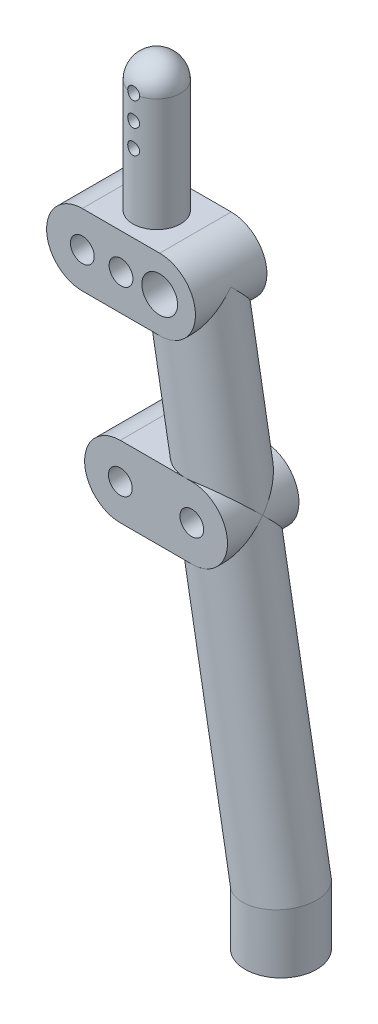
ISO-10303-21;
HEADER;
FILE_DESCRIPTION(('STEP AP214'),'2;1');
FILE_NAME('part.step','',(''),(''),'','','');
FILE_SCHEMA(('AUTOMOTIVE_DESIGN { 1 0 10303 214 1 1 1 1 }'));
ENDSEC;
DATA;
#1=APPLICATION_CONTEXT('core data for automotive mechanical design processes');
#2=APPLICATION_PROTOCOL_DEFINITION('international standard','automotive_design',2000,#1);
#3=PRODUCT_CONTEXT('',#1,'mechanical');
#4=PRODUCT('Part','Part','',(#3));
#5=PRODUCT_RELATED_PRODUCT_CATEGORY('part','',(#4));
#6=PRODUCT_DEFINITION_FORMATION('','',#4);
#7=PRODUCT_DEFINITION_CONTEXT('part definition',#1,'design');
#8=PRODUCT_DEFINITION('design','',#6,#7);
#9=PRODUCT_DEFINITION_SHAPE('','',#8);
#10=(LENGTH_UNIT() NAMED_UNIT(*) SI_UNIT(.MILLI.,.METRE.));
#11=(NAMED_UNIT(*) PLANE_ANGLE_UNIT() SI_UNIT($,.RADIAN.));
#12=(NAMED_UNIT(*) SI_UNIT($,.STERADIAN.) SOLID_ANGLE_UNIT());
#13=UNCERTAINTY_MEASURE_WITH_UNIT(LENGTH_MEASURE(1.E-05),#10,'distance_accuracy_value','');
#14=(GEOMETRIC_REPRESENTATION_CONTEXT(3) GLOBAL_UNCERTAINTY_ASSIGNED_CONTEXT((#13)) GLOBAL_UNIT_ASSIGNED_CONTEXT((#10,
#11,#12)) REPRESENTATION_CONTEXT('',''));
#15=CARTESIAN_POINT('',(0.,0.,0.));
#16=DIRECTION('',(0.,0.,1.));
#17=DIRECTION('',(1.,0.,0.));
#18=AXIS2_PLACEMENT_3D('',#15,#16,#17);
#19=CARTESIAN_POINT('',(-6.5,25.,0.));
#20=DIRECTION('',(1.,0.,0.));
#21=DIRECTION('',(0.,0.,-1.));
#22=AXIS2_PLACEMENT_3D('',#19,#20,#21);
#23=SPHERICAL_SURFACE('',#22,4.);
#24=CARTESIAN_POINT('',(-6.5,25.,0.));
#25=DIRECTION('',(0.,1.,0.));
#26=DIRECTION('',(0.,0.,1.));
#27=AXIS2_PLACEMENT_3D('',#24,#25,#26);
#28=CIRCLE('',#27,4.);
#29=CARTESIAN_POINT('',(-5.49999999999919,25.,-3.87298334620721));
#30=VERTEX_POINT('',#29);
#31=CARTESIAN_POINT('',(-2.5,25.,0.));
#32=VERTEX_POINT('',#31);
#33=EDGE_CURVE('E158',#30,#32,#28,.F.);
#34=ORIENTED_EDGE('',*,*,#33,.F.);
#35=CARTESIAN_POINT('',(-6.5,25.,-3.872983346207));
#36=DIRECTION('',(0.,0.,1.));
#37=DIRECTION('',(1.,0.,0.));
#38=AXIS2_PLACEMENT_3D('',#35,#36,#37);
#39=CIRCLE('',#38,1.);
#40=CARTESIAN_POINT('',(-7.50000000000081,25.,-3.87298334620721));
#41=VERTEX_POINT('',#40);
#42=EDGE_CURVE('E147',#30,#41,#39,.T.);
#43=ORIENTED_EDGE('',*,*,#42,.T.);
#44=CARTESIAN_POINT('',(-6.5,25.,0.));
#45=DIRECTION('',(0.,1.,0.));
#46=DIRECTION('',(0.,0.,1.));
#47=AXIS2_PLACEMENT_3D('',#44,#45,#46);
#48=CIRCLE('',#47,4.);
#49=CARTESIAN_POINT('',(-10.5,25.,0.));
#50=VERTEX_POINT('',#49);
#51=EDGE_CURVE('E168',#50,#41,#48,.F.);
#52=ORIENTED_EDGE('',*,*,#51,.F.);
#53=CARTESIAN_POINT('',(-6.5,25.,0.));
#54=DIRECTION('',(0.,1.,0.));
#55=DIRECTION('',(0.,0.,1.));
#56=AXIS2_PLACEMENT_3D('',#53,#54,#55);
#57=CIRCLE('',#56,4.);
#58=CARTESIAN_POINT('',(-7.50000000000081,25.,3.87298334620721));
#59=VERTEX_POINT('',#58);
#60=EDGE_CURVE('E145',#59,#50,#57,.F.);
#61=ORIENTED_EDGE('',*,*,#60,.F.);
#62=CARTESIAN_POINT('',(-6.5,25.,3.872983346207));
#63=DIRECTION('',(0.,0.,1.));
#64=DIRECTION('',(1.,0.,0.));
#65=AXIS2_PLACEMENT_3D('',#62,#63,#64);
#66=CIRCLE('',#65,1.);
#67=CARTESIAN_POINT('',(-5.49999999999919,25.,3.87298334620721));
#68=VERTEX_POINT('',#67);
#69=EDGE_CURVE('E20',#59,#68,#66,.F.);
#70=ORIENTED_EDGE('',*,*,#69,.T.);
#71=CARTESIAN_POINT('',(-6.5,25.,0.));
#72=DIRECTION('',(0.,1.,0.));
#73=DIRECTION('',(0.,0.,1.));
#74=AXIS2_PLACEMENT_3D('',#71,#72,#73);
#75=CIRCLE('',#74,4.);
#76=EDGE_CURVE('E141',#32,#68,#75,.F.);
#77=ORIENTED_EDGE('',*,*,#76,.F.);
#78=EDGE_LOOP('',(#34,#43,#52,#61,#70,#77));
#79=FACE_BOUND('',#78,.T.);
#80=ADVANCED_FACE('F16',(#79),#23,.T.);
#81=CARTESIAN_POINT('',(-6.5,25.,-7.209216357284));
#82=DIRECTION('',(0.,0.,1.));
#83=DIRECTION('',(1.,0.,0.));
#84=AXIS2_PLACEMENT_3D('',#81,#82,#83);
#85=CYLINDRICAL_SURFACE('',#84,1.);
#86=CARTESIAN_POINT('',(-5.5,25.,3.87298334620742));
#87=CARTESIAN_POINT('',(-5.49999966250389,24.9723370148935,3.87298148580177));
#88=CARTESIAN_POINT('',(-5.50114859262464,24.9446877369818,3.87328009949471));
#89=CARTESIAN_POINT('',(-5.50572870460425,24.8895959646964,3.87445904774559));
#90=CARTESIAN_POINT('',(-5.50915950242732,24.8621534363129,3.87533928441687));
#91=CARTESIAN_POINT('',(-5.52282476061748,24.7805468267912,3.87881710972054));
#92=CARTESIAN_POINT('',(-5.53643230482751,24.7269435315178,3.88225203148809));
#93=CARTESIAN_POINT('',(-5.57220192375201,24.622875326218,3.89095422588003));
#94=CARTESIAN_POINT('',(-5.59436319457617,24.5724101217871,3.8962213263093));
#95=CARTESIAN_POINT('',(-5.64658462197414,24.4758885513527,3.90799134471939));
#96=CARTESIAN_POINT('',(-5.67664689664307,24.429833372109,3.91449459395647));
#97=CARTESIAN_POINT('',(-5.74451552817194,24.3424561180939,3.92816262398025));
#98=CARTESIAN_POINT('',(-5.78246273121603,24.3012451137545,3.93533791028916));
#99=CARTESIAN_POINT('',(-5.86472421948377,24.2256979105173,3.94945104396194));
#100=CARTESIAN_POINT('',(-5.90903952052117,24.1913628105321,3.95638885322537));
#101=CARTESIAN_POINT('',(-6.00354310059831,24.1300889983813,3.96936182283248));
#102=CARTESIAN_POINT('',(-6.05380465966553,24.103260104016,3.9753830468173));
#103=CARTESIAN_POINT('',(-6.15829740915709,24.0584752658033,3.98572346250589));
#104=CARTESIAN_POINT('',(-6.21252781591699,24.0405175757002,3.99004298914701));
#105=CARTESIAN_POINT('',(-6.32225589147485,24.0143410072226,3.99641900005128));
#106=CARTESIAN_POINT('',(-6.37770567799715,24.0059323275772,3.99851952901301));
#107=CARTESIAN_POINT('',(-6.48926722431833,23.9984966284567,4.00037438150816));
#108=CARTESIAN_POINT('',(-6.54537890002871,23.9994684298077,4.00012899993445));
#109=CARTESIAN_POINT('',(-6.6553524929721,24.0106299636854,3.99735237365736));
#110=CARTESIAN_POINT('',(-6.70923670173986,24.0206146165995,3.99487198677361));
#111=CARTESIAN_POINT('',(-6.81453871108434,24.0491886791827,3.98796330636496));
#112=CARTESIAN_POINT('',(-6.86595640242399,24.0677784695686,3.98353492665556));
#113=CARTESIAN_POINT('',(-6.96540728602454,24.1132012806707,3.97314997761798));
#114=CARTESIAN_POINT('',(-7.01340562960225,24.1401073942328,3.96717993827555));
#115=CARTESIAN_POINT('',(-7.10427663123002,24.2013431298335,3.95435945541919));
#116=CARTESIAN_POINT('',(-7.14714851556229,24.2356738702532,3.94750887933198));
#117=CARTESIAN_POINT('',(-7.22776938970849,24.3118789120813,3.93345566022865));
#118=CARTESIAN_POINT('',(-7.26534910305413,24.3539316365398,3.92624850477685));
#119=CARTESIAN_POINT('',(-7.33296957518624,24.4438298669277,3.91246168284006));
#120=CARTESIAN_POINT('',(-7.36300827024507,24.4916769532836,3.90588218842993));
#121=CARTESIAN_POINT('',(-7.41480470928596,24.5921455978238,3.89407813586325));
#122=CARTESIAN_POINT('',(-7.43651701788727,24.6447914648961,3.88886106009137));
#123=CARTESIAN_POINT('',(-7.47070235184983,24.7531169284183,3.88047058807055));
#124=CARTESIAN_POINT('',(-7.48318918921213,24.8087918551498,3.87729413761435));
#125=CARTESIAN_POINT('',(-7.49390463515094,24.8874573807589,3.87455290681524));
#126=CARTESIAN_POINT('',(-7.49619079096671,24.9099197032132,3.8739652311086));
#127=CARTESIAN_POINT('',(-7.49923675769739,24.9549177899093,3.87318062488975));
#128=CARTESIAN_POINT('',(-7.49999903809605,24.9774533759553,3.87298306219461));
#129=CARTESIAN_POINT('',(-7.5,25.,3.87298334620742));
#130=B_SPLINE_CURVE_WITH_KNOTS('',3,(#86,#87,#88,#89,#90,#91,#92,#93,#94,#95,#96,#97,#98,#99,
#100,#101,#102,#103,#104,#105,#106,#107,#108,#109,#110,#111,#112,#113,#114,#115,#116,#117,#118,
#119,#120,#121,#122,#123,#124,#125,#126,#127,#128,#129),.UNSPECIFIED.,.F.,.F.,(4,2,2,2,2,2,2,2,
2,2,2,2,2,2,2,2,2,2,2,2,2,4),(0.,0.0829365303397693,0.16585910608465,0.331229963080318,
0.4965852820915,0.661984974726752,0.830641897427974,0.999325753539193,1.17036187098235,
1.34136430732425,1.50890481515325,1.67642426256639,1.84022545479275,2.00403389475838,
2.16932509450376,2.33464120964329,2.50441429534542,2.67423379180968,2.84496720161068,
3.01544447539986,3.08315848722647,3.15076267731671),.UNSPECIFIED.);
#131=EDGE_CURVE('E148',#68,#59,#130,.T.);
#132=ORIENTED_EDGE('',*,*,#131,.F.);
#133=ORIENTED_EDGE('',*,*,#69,.F.);
#134=EDGE_LOOP('',(#132,#133));
#135=FACE_BOUND('',#134,.T.);
#136=ORIENTED_EDGE('',*,*,#42,.F.);
#137=CARTESIAN_POINT('',(-7.5,25.,-3.87298334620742));
#138=CARTESIAN_POINT('',(-7.50000033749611,24.9723370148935,-3.87298148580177));
#139=CARTESIAN_POINT('',(-7.49885140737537,24.9446877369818,-3.87328009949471));
#140=CARTESIAN_POINT('',(-7.49427129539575,24.8895959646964,-3.87445904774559));
#141=CARTESIAN_POINT('',(-7.49084049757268,24.8621534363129,-3.87533928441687));
#142=CARTESIAN_POINT('',(-7.47717523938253,24.7805468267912,-3.87881710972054));
#143=CARTESIAN_POINT('',(-7.46356769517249,24.7269435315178,-3.88225203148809));
#144=CARTESIAN_POINT('',(-7.42779807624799,24.622875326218,-3.89095422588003));
#145=CARTESIAN_POINT('',(-7.40563680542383,24.5724101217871,-3.8962213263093));
#146=CARTESIAN_POINT('',(-7.35341537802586,24.4758885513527,-3.90799134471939));
#147=CARTESIAN_POINT('',(-7.32335310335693,24.429833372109,-3.91449459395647));
#148=CARTESIAN_POINT('',(-7.25548447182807,24.3424561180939,-3.92816262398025));
#149=CARTESIAN_POINT('',(-7.21753726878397,24.3012451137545,-3.93533791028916));
#150=CARTESIAN_POINT('',(-7.13527578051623,24.2256979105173,-3.94945104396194));
#151=CARTESIAN_POINT('',(-7.09096047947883,24.1913628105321,-3.95638885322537));
#152=CARTESIAN_POINT('',(-6.99645689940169,24.1300889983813,-3.96936182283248));
#153=CARTESIAN_POINT('',(-6.94619534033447,24.103260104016,-3.9753830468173));
#154=CARTESIAN_POINT('',(-6.84170259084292,24.0584752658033,-3.98572346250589));
#155=CARTESIAN_POINT('',(-6.78747218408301,24.0405175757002,-3.99004298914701));
#156=CARTESIAN_POINT('',(-6.67774410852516,24.0143410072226,-3.99641900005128));
#157=CARTESIAN_POINT('',(-6.62229432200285,24.0059323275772,-3.99851952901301));
#158=CARTESIAN_POINT('',(-6.51073277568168,23.9984966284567,-4.00037438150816));
#159=CARTESIAN_POINT('',(-6.45462109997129,23.9994684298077,-4.00012899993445));
#160=CARTESIAN_POINT('',(-6.3446475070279,24.0106299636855,-3.99735237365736));
#161=CARTESIAN_POINT('',(-6.29076329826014,24.0206146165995,-3.99487198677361));
#162=CARTESIAN_POINT('',(-6.18546128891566,24.0491886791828,-3.98796330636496));
#163=CARTESIAN_POINT('',(-6.13404359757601,24.0677784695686,-3.98353492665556));
#164=CARTESIAN_POINT('',(-6.03459271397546,24.1132012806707,-3.97314997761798));
#165=CARTESIAN_POINT('',(-5.98659437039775,24.1401073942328,-3.96717993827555));
#166=CARTESIAN_POINT('',(-5.89572336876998,24.2013431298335,-3.95435945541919));
#167=CARTESIAN_POINT('',(-5.85285148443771,24.2356738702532,-3.94750887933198));
#168=CARTESIAN_POINT('',(-5.77223061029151,24.3118789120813,-3.93345566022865));
#169=CARTESIAN_POINT('',(-5.73465089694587,24.3539316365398,-3.92624850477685));
#170=CARTESIAN_POINT('',(-5.66703042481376,24.4438298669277,-3.91246168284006));
#171=CARTESIAN_POINT('',(-5.63699172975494,24.4916769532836,-3.90588218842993));
#172=CARTESIAN_POINT('',(-5.58519529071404,24.5921455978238,-3.89407813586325));
#173=CARTESIAN_POINT('',(-5.56348298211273,24.6447914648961,-3.88886106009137));
#174=CARTESIAN_POINT('',(-5.52929764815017,24.7531169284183,-3.88047058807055));
#175=CARTESIAN_POINT('',(-5.51681081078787,24.8087918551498,-3.87729413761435));
#176=CARTESIAN_POINT('',(-5.50609536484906,24.8874573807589,-3.87455290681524));
#177=CARTESIAN_POINT('',(-5.50380920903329,24.9099197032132,-3.8739652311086));
#178=CARTESIAN_POINT('',(-5.50076324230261,24.9549177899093,-3.87318062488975));
#179=CARTESIAN_POINT('',(-5.50000096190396,24.9774533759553,-3.87298306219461));
#180=CARTESIAN_POINT('',(-5.5,25.,-3.87298334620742));
#181=B_SPLINE_CURVE_WITH_KNOTS('',3,(#137,#138,#139,#140,#141,#142,#143,#144,#145,#146,#147,
#148,#149,#150,#151,#152,#153,#154,#155,#156,#157,#158,#159,#160,#161,#162,#163,#164,#165,#166,
#167,#168,#169,#170,#171,#172,#173,#174,#175,#176,#177,#178,#179,#180),.UNSPECIFIED.,.F.,.F.,(4,
2,2,2,2,2,2,2,2,2,2,2,2,2,2,2,2,2,2,2,2,4),(0.,0.0829365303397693,0.16585910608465,
0.331229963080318,0.4965852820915,0.661984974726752,0.830641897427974,0.999325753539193,
1.17036187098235,1.34136430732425,1.50890481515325,1.67642426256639,1.84022545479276,
2.00403389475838,2.16932509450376,2.33464120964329,2.50441429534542,2.67423379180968,
2.84496720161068,3.01544447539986,3.08315848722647,3.15076267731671),.UNSPECIFIED.);
#182=EDGE_CURVE('E170',#41,#30,#181,.T.);
#183=ORIENTED_EDGE('',*,*,#182,.F.);
#184=EDGE_LOOP('',(#136,#183));
#185=FACE_BOUND('',#184,.T.);
#186=ADVANCED_FACE('F149',(#135,#185),#85,.F.);
#187=CARTESIAN_POINT('',(-6.5,17.,-7.209216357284));
#188=DIRECTION('',(0.,0.,1.));
#189=DIRECTION('',(1.,0.,0.));
#190=AXIS2_PLACEMENT_3D('',#187,#188,#189);
#191=CYLINDRICAL_SURFACE('',#190,1.);
#192=CARTESIAN_POINT('',(-7.5,17.,3.87298334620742));
#193=CARTESIAN_POINT('',(-7.49999715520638,17.0551563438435,3.87298517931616));
#194=CARTESIAN_POINT('',(-7.49541624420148,17.1103777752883,3.87417583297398));
#195=CARTESIAN_POINT('',(-7.47722748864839,17.2192837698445,3.87880273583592));
#196=CARTESIAN_POINT('',(-7.46360254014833,17.272965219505,3.88224323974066));
#197=CARTESIAN_POINT('',(-7.4277937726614,17.377127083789,3.8909555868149));
#198=CARTESIAN_POINT('',(-7.40562538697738,17.4276130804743,3.89622412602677));
#199=CARTESIAN_POINT('',(-7.35339971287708,17.5241383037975,3.907994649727));
#200=CARTESIAN_POINT('',(-7.32334438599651,17.5701786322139,3.91449632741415));
#201=CARTESIAN_POINT('',(-7.25548430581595,17.6575432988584,3.92816267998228));
#202=CARTESIAN_POINT('',(-7.21753683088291,17.6987551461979,3.9353379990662));
#203=CARTESIAN_POINT('',(-7.1352752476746,17.7743027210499,3.94945112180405));
#204=CARTESIAN_POINT('',(-7.09096019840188,17.8086374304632,3.95638889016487));
#205=CARTESIAN_POINT('',(-6.99645789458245,17.8699102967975,3.96936168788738));
#206=CARTESIAN_POINT('',(-6.94619744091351,17.8967387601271,3.97538279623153));
#207=CARTESIAN_POINT('',(-6.84170485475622,17.9415239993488,3.98572328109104));
#208=CARTESIAN_POINT('',(-6.78747334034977,17.9594821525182,3.99004292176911));
#209=CARTESIAN_POINT('',(-6.67774353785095,17.9856591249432,3.99641903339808));
#210=CARTESIAN_POINT('',(-6.62229315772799,17.9940678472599,3.99851957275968));
#211=CARTESIAN_POINT('',(-6.51073159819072,18.0015033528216,4.00037437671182));
#212=CARTESIAN_POINT('',(-6.45462051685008,18.0005315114,4.00012898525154));
#213=CARTESIAN_POINT('',(-6.34464792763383,17.9893700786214,3.99735238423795));
#214=CARTESIAN_POINT('',(-6.29076413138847,17.9793855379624,3.99487202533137));
#215=CARTESIAN_POINT('',(-6.18546208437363,17.9508116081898,3.98796337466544));
#216=CARTESIAN_POINT('',(-6.1340439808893,17.9322217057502,3.98353496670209));
#217=CARTESIAN_POINT('',(-6.03459163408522,17.8867982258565,3.97314986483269));
#218=CARTESIAN_POINT('',(-5.98659229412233,17.859891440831,3.96717967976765));
#219=CARTESIAN_POINT('',(-5.8957215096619,17.7986553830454,3.95435915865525));
#220=CARTESIAN_POINT('',(-5.85285061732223,17.7643253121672,3.94750872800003));
#221=CARTESIAN_POINT('',(-5.77223410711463,17.6881243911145,3.93345626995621));
#222=CARTESIAN_POINT('',(-5.73465734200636,17.6460755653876,3.92624974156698));
#223=CARTESIAN_POINT('',(-5.6670355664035,17.5561783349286,3.91246280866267));
#224=CARTESIAN_POINT('',(-5.63699390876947,17.5083273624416,3.90588268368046));
#225=CARTESIAN_POINT('',(-5.58518730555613,17.4078388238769,3.89407631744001));
#226=CARTESIAN_POINT('',(-5.56346970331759,17.3551759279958,3.88885787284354));
#227=CARTESIAN_POINT('',(-5.52928973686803,17.2468485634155,3.88046857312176));
#228=CARTESIAN_POINT('',(-5.51680788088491,17.1911906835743,3.87729340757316));
#229=CARTESIAN_POINT('',(-5.50609806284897,17.1125608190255,3.87455358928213));
#230=CARTESIAN_POINT('',(-5.50381351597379,17.0901168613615,3.87396631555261));
#231=CARTESIAN_POINT('',(-5.50076390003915,17.0451189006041,3.87318081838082));
#232=CARTESIAN_POINT('',(-5.4999988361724,17.0225648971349,3.87298259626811));
#233=CARTESIAN_POINT('',(-5.50000284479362,16.9448436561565,3.87298517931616));
#234=CARTESIAN_POINT('',(-5.50458375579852,16.8896222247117,3.87417583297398));
#235=CARTESIAN_POINT('',(-5.52277251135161,16.7807162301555,3.87880273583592));
#236=CARTESIAN_POINT('',(-5.53639745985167,16.727034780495,3.88224323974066));
#237=CARTESIAN_POINT('',(-5.57220622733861,16.622872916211,3.8909555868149));
#238=CARTESIAN_POINT('',(-5.59437461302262,16.5723869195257,3.89622412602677));
#239=CARTESIAN_POINT('',(-5.64660028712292,16.4758616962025,3.907994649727));
#240=CARTESIAN_POINT('',(-5.67665561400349,16.4298213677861,3.91449632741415));
#241=CARTESIAN_POINT('',(-5.74451569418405,16.3424567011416,3.92816267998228));
#242=CARTESIAN_POINT('',(-5.78246316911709,16.3012448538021,3.9353379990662));
#243=CARTESIAN_POINT('',(-5.8647247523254,16.2256972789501,3.94945112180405));
#244=CARTESIAN_POINT('',(-5.90903980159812,16.1913625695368,3.95638889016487));
#245=CARTESIAN_POINT('',(-6.00354210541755,16.1300897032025,3.96936168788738));
#246=CARTESIAN_POINT('',(-6.05380255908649,16.1032612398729,3.97538279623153));
#247=CARTESIAN_POINT('',(-6.15829514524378,16.0584760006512,3.98572328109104));
#248=CARTESIAN_POINT('',(-6.21252665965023,16.0405178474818,3.99004292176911));
#249=CARTESIAN_POINT('',(-6.32225646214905,16.0143408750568,3.99641903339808));
#250=CARTESIAN_POINT('',(-6.37770684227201,16.0059321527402,3.99851957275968));
#251=CARTESIAN_POINT('',(-6.48926840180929,15.9984966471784,4.00037437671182));
#252=CARTESIAN_POINT('',(-6.54537948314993,15.9994684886,4.00012898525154));
#253=CARTESIAN_POINT('',(-6.65535207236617,16.0106299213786,3.99735238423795));
#254=CARTESIAN_POINT('',(-6.70923586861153,16.0206144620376,3.99487202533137));
#255=CARTESIAN_POINT('',(-6.81453791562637,16.0491883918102,3.98796337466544));
#256=CARTESIAN_POINT('',(-6.8659560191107,16.0677782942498,3.98353496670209));
#257=CARTESIAN_POINT('',(-6.96540836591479,16.1132017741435,3.97314986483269));
#258=CARTESIAN_POINT('',(-7.01340770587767,16.140108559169,3.96717967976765));
#259=CARTESIAN_POINT('',(-7.1042784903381,16.2013446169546,3.95435915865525));
#260=CARTESIAN_POINT('',(-7.14714938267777,16.2356746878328,3.94750872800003));
#261=CARTESIAN_POINT('',(-7.22776589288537,16.3118756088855,3.93345626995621));
#262=CARTESIAN_POINT('',(-7.26534265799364,16.3539244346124,3.92624974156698));
#263=CARTESIAN_POINT('',(-7.3329644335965,16.4438216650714,3.91246280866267));
#264=CARTESIAN_POINT('',(-7.36300609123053,16.4916726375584,3.90588268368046));
#265=CARTESIAN_POINT('',(-7.41481269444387,16.5921611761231,3.89407631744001));
#266=CARTESIAN_POINT('',(-7.43653029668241,16.6448240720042,3.88885787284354));
#267=CARTESIAN_POINT('',(-7.47071026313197,16.7531514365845,3.88046857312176));
#268=CARTESIAN_POINT('',(-7.4831921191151,16.8088093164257,3.87729340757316));
#269=CARTESIAN_POINT('',(-7.49390193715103,16.8874391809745,3.87455358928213));
#270=CARTESIAN_POINT('',(-7.49618648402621,16.9098831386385,3.87396631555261));
#271=CARTESIAN_POINT('',(-7.49923609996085,16.9548810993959,3.87318081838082));
#272=CARTESIAN_POINT('',(-7.5000011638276,16.9774351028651,3.87298259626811));
#273=CARTESIAN_POINT('',(-7.5,17.,3.87298334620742));
#274=B_SPLINE_CURVE_WITH_KNOTS('',3,(#192,#193,#194,#195,#196,#197,#198,#199,#200,#201,#202,
#203,#204,#205,#206,#207,#208,#209,#210,#211,#212,#213,#214,#215,#216,#217,#218,#219,#220,#221,
#222,#223,#224,#225,#226,#227,#228,#229,#230,#231,#232,#233,#234,#235,#236,#237,#238,#239,#240,
#241,#242,#243,#244,#245,#246,#247,#248,#249,#250,#251,#252,#253,#254,#255,#256,#257,#258,#259,
#260,#261,#262,#263,#264,#265,#266,#267,#268,#269,#270,#271,#272,#273),.UNSPECIFIED.,.T.,.F.,(4,
2,2,2,2,2,2,2,2,2,2,2,2,2,2,2,2,2,2,2,2,2,2,2,2,2,2,2,2,2,2,2,2,2,2,2,2,2,2,2,4),(0.,
0.165382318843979,0.331078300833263,0.49647635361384,0.661833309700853,0.830491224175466,
0.999174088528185,1.17020664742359,1.34121264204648,1.50875490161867,1.67627259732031,
1.84007252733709,2.00388222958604,2.16917699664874,2.33448954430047,2.50424813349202,
2.67408212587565,2.8448682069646,3.01529281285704,3.08295179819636,3.15061101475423,
3.31599333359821,3.48168931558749,3.64708736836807,3.81244432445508,3.9811022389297,
4.14978510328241,4.32081766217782,4.49182365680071,4.6593659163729,4.82688361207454,
4.99068354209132,5.15449324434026,5.31978801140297,5.4851005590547,5.65485914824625,
5.82469314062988,5.99547922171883,6.16590382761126,6.23356281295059,6.30122202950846),.UNSPECIFIED.);
#275=CARTESIAN_POINT('',(-7.5,17.,3.87298334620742));
#276=VERTEX_POINT('',#275);
#277=EDGE_CURVE('E152',#276,#276,#274,.T.);
#278=ORIENTED_EDGE('',*,*,#277,.F.);
#279=EDGE_LOOP('',(#278));
#280=FACE_BOUND('',#279,.T.);
#281=CARTESIAN_POINT('',(-5.5,17.,-3.87298334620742));
#282=CARTESIAN_POINT('',(-5.50000284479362,17.0551563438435,-3.87298517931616));
#283=CARTESIAN_POINT('',(-5.50458375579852,17.1103777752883,-3.87417583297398));
#284=CARTESIAN_POINT('',(-5.52277251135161,17.2192837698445,-3.87880273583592));
#285=CARTESIAN_POINT('',(-5.53639745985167,17.272965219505,-3.88224323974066));
#286=CARTESIAN_POINT('',(-5.57220622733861,17.377127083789,-3.8909555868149));
#287=CARTESIAN_POINT('',(-5.59437461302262,17.4276130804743,-3.89622412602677));
#288=CARTESIAN_POINT('',(-5.64660028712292,17.5241383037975,-3.907994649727));
#289=CARTESIAN_POINT('',(-5.67665561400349,17.5701786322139,-3.91449632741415));
#290=CARTESIAN_POINT('',(-5.74451569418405,17.6575432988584,-3.92816267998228));
#291=CARTESIAN_POINT('',(-5.78246316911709,17.6987551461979,-3.9353379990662));
#292=CARTESIAN_POINT('',(-5.8647247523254,17.7743027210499,-3.94945112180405));
#293=CARTESIAN_POINT('',(-5.90903980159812,17.8086374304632,-3.95638889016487));
#294=CARTESIAN_POINT('',(-6.00354210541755,17.8699102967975,-3.96936168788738));
#295=CARTESIAN_POINT('',(-6.05380255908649,17.8967387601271,-3.97538279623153));
#296=CARTESIAN_POINT('',(-6.15829514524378,17.9415239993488,-3.98572328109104));
#297=CARTESIAN_POINT('',(-6.21252665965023,17.9594821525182,-3.99004292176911));
#298=CARTESIAN_POINT('',(-6.32225646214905,17.9856591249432,-3.99641903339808));
#299=CARTESIAN_POINT('',(-6.37770684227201,17.9940678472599,-3.99851957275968));
#300=CARTESIAN_POINT('',(-6.48926840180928,18.0015033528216,-4.00037437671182));
#301=CARTESIAN_POINT('',(-6.54537948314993,18.0005315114,-4.00012898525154));
#302=CARTESIAN_POINT('',(-6.65535207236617,17.9893700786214,-3.99735238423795));
#303=CARTESIAN_POINT('',(-6.70923586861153,17.9793855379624,-3.99487202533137));
#304=CARTESIAN_POINT('',(-6.81453791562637,17.9508116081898,-3.98796337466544));
#305=CARTESIAN_POINT('',(-6.8659560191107,17.9322217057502,-3.98353496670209));
#306=CARTESIAN_POINT('',(-6.96540836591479,17.8867982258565,-3.97314986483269));
#307=CARTESIAN_POINT('',(-7.01340770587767,17.859891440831,-3.96717967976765));
#308=CARTESIAN_POINT('',(-7.1042784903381,17.7986553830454,-3.95435915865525));
#309=CARTESIAN_POINT('',(-7.14714938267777,17.7643253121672,-3.94750872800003));
#310=CARTESIAN_POINT('',(-7.22776589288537,17.6881243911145,-3.93345626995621));
#311=CARTESIAN_POINT('',(-7.26534265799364,17.6460755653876,-3.92624974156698));
#312=CARTESIAN_POINT('',(-7.3329644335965,17.5561783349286,-3.91246280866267));
#313=CARTESIAN_POINT('',(-7.36300609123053,17.5083273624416,-3.90588268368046));
#314=CARTESIAN_POINT('',(-7.41481269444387,17.4078388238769,-3.89407631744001));
#315=CARTESIAN_POINT('',(-7.43653029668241,17.3551759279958,-3.88885787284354));
#316=CARTESIAN_POINT('',(-7.47071026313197,17.2468485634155,-3.88046857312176));
#317=CARTESIAN_POINT('',(-7.4831921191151,17.1911906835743,-3.87729340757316));
#318=CARTESIAN_POINT('',(-7.49390193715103,17.1125608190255,-3.87455358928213));
#319=CARTESIAN_POINT('',(-7.49618648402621,17.0901168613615,-3.87396631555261));
#320=CARTESIAN_POINT('',(-7.49923609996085,17.0451189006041,-3.87318081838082));
#321=CARTESIAN_POINT('',(-7.5000011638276,17.0225648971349,-3.87298259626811));
#322=CARTESIAN_POINT('',(-7.49999715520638,16.9448436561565,-3.87298517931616));
#323=CARTESIAN_POINT('',(-7.49541624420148,16.8896222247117,-3.87417583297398));
#324=CARTESIAN_POINT('',(-7.47722748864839,16.7807162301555,-3.87880273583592));
#325=CARTESIAN_POINT('',(-7.46360254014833,16.727034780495,-3.88224323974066));
#326=CARTESIAN_POINT('',(-7.4277937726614,16.622872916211,-3.8909555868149));
#327=CARTESIAN_POINT('',(-7.40562538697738,16.5723869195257,-3.89622412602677));
#328=CARTESIAN_POINT('',(-7.35339971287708,16.4758616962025,-3.907994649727));
#329=CARTESIAN_POINT('',(-7.32334438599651,16.4298213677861,-3.91449632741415));
#330=CARTESIAN_POINT('',(-7.25548430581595,16.3424567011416,-3.92816267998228));
#331=CARTESIAN_POINT('',(-7.21753683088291,16.3012448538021,-3.9353379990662));
#332=CARTESIAN_POINT('',(-7.1352752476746,16.2256972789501,-3.94945112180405));
#333=CARTESIAN_POINT('',(-7.09096019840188,16.1913625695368,-3.95638889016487));
#334=CARTESIAN_POINT('',(-6.99645789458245,16.1300897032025,-3.96936168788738));
#335=CARTESIAN_POINT('',(-6.94619744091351,16.1032612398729,-3.97538279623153));
#336=CARTESIAN_POINT('',(-6.84170485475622,16.0584760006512,-3.98572328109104));
#337=CARTESIAN_POINT('',(-6.78747334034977,16.0405178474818,-3.99004292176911));
#338=CARTESIAN_POINT('',(-6.67774353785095,16.0143408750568,-3.99641903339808));
#339=CARTESIAN_POINT('',(-6.62229315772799,16.0059321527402,-3.99851957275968));
#340=CARTESIAN_POINT('',(-6.51073159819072,15.9984966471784,-4.00037437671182));
#341=CARTESIAN_POINT('',(-6.45462051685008,15.9994684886,-4.00012898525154));
#342=CARTESIAN_POINT('',(-6.34464792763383,16.0106299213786,-3.99735238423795));
#343=CARTESIAN_POINT('',(-6.29076413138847,16.0206144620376,-3.99487202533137));
#344=CARTESIAN_POINT('',(-6.18546208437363,16.0491883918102,-3.98796337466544));
#345=CARTESIAN_POINT('',(-6.1340439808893,16.0677782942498,-3.98353496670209));
#346=CARTESIAN_POINT('',(-6.03459163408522,16.1132017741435,-3.97314986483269));
#347=CARTESIAN_POINT('',(-5.98659229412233,16.140108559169,-3.96717967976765));
#348=CARTESIAN_POINT('',(-5.8957215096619,16.2013446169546,-3.95435915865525));
#349=CARTESIAN_POINT('',(-5.85285061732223,16.2356746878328,-3.94750872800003));
#350=CARTESIAN_POINT('',(-5.77223410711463,16.3118756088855,-3.93345626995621));
#351=CARTESIAN_POINT('',(-5.73465734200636,16.3539244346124,-3.92624974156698));
#352=CARTESIAN_POINT('',(-5.6670355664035,16.4438216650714,-3.91246280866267));
#353=CARTESIAN_POINT('',(-5.63699390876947,16.4916726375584,-3.90588268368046));
#354=CARTESIAN_POINT('',(-5.58518730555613,16.5921611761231,-3.89407631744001));
#355=CARTESIAN_POINT('',(-5.56346970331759,16.6448240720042,-3.88885787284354));
#356=CARTESIAN_POINT('',(-5.52928973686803,16.7531514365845,-3.88046857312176));
#357=CARTESIAN_POINT('',(-5.51680788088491,16.8088093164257,-3.87729340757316));
#358=CARTESIAN_POINT('',(-5.50609806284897,16.8874391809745,-3.87455358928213));
#359=CARTESIAN_POINT('',(-5.50381351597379,16.9098831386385,-3.87396631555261));
#360=CARTESIAN_POINT('',(-5.50076390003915,16.9548810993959,-3.87318081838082));
#361=CARTESIAN_POINT('',(-5.4999988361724,16.9774351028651,-3.87298259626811));
#362=CARTESIAN_POINT('',(-5.5,17.,-3.87298334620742));
#363=B_SPLINE_CURVE_WITH_KNOTS('',3,(#281,#282,#283,#284,#285,#286,#287,#288,#289,#290,#291,
#292,#293,#294,#295,#296,#297,#298,#299,#300,#301,#302,#303,#304,#305,#306,#307,#308,#309,#310,
#311,#312,#313,#314,#315,#316,#317,#318,#319,#320,#321,#322,#323,#324,#325,#326,#327,#328,#329,
#330,#331,#332,#333,#334,#335,#336,#337,#338,#339,#340,#341,#342,#343,#344,#345,#346,#347,#348,
#349,#350,#351,#352,#353,#354,#355,#356,#357,#358,#359,#360,#361,#362),.UNSPECIFIED.,.T.,.F.,(4,
2,2,2,2,2,2,2,2,2,2,2,2,2,2,2,2,2,2,2,2,2,2,2,2,2,2,2,2,2,2,2,2,2,2,2,2,2,2,2,4),(0.,
0.165382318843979,0.331078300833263,0.496476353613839,0.661833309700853,0.830491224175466,
0.999174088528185,1.17020664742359,1.34121264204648,1.50875490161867,1.67627259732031,
1.84007252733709,2.00388222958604,2.16917699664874,2.33448954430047,2.50424813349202,
2.67408212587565,2.8448682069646,3.01529281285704,3.08295179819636,3.15061101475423,
3.31599333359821,3.48168931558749,3.64708736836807,3.81244432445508,3.9811022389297,
4.14978510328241,4.32081766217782,4.49182365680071,4.6593659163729,4.82688361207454,
4.99068354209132,5.15449324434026,5.31978801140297,5.4851005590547,5.65485914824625,
5.82469314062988,5.99547922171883,6.16590382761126,6.23356281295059,6.30122202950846),.UNSPECIFIED.);
#364=CARTESIAN_POINT('',(-5.5,17.,-3.87298334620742));
#365=VERTEX_POINT('',#364);
#366=EDGE_CURVE('E352',#365,#365,#363,.T.);
#367=ORIENTED_EDGE('',*,*,#366,.F.);
#368=EDGE_LOOP('',(#367));
#369=FACE_BOUND('',#368,.T.);
#370=ADVANCED_FACE('F387',(#280,#369),#191,.F.);
#371=CARTESIAN_POINT('',(-6.5,21.,-7.209216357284));
#372=DIRECTION('',(0.,0.,1.));
#373=DIRECTION('',(1.,0.,0.));
#374=AXIS2_PLACEMENT_3D('',#371,#372,#373);
#375=CYLINDRICAL_SURFACE('',#374,1.);
#376=CARTESIAN_POINT('',(-7.5,21.,3.87298334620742));
#377=CARTESIAN_POINT('',(-7.49999715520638,21.0551563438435,3.87298517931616));
#378=CARTESIAN_POINT('',(-7.49541624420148,21.1103777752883,3.87417583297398));
#379=CARTESIAN_POINT('',(-7.47722748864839,21.2192837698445,3.87880273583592));
#380=CARTESIAN_POINT('',(-7.46360254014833,21.272965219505,3.88224323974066));
#381=CARTESIAN_POINT('',(-7.42779377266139,21.3771270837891,3.8909555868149));
#382=CARTESIAN_POINT('',(-7.40562538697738,21.4276130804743,3.89622412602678));
#383=CARTESIAN_POINT('',(-7.35339971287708,21.5241383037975,3.907994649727));
#384=CARTESIAN_POINT('',(-7.32334438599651,21.5701786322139,3.91449632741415));
#385=CARTESIAN_POINT('',(-7.25548430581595,21.6575432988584,3.92816267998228));
#386=CARTESIAN_POINT('',(-7.21753683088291,21.6987551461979,3.9353379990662));
#387=CARTESIAN_POINT('',(-7.1352752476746,21.7743027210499,3.94945112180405));
#388=CARTESIAN_POINT('',(-7.09096019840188,21.8086374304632,3.95638889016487));
#389=CARTESIAN_POINT('',(-6.99645789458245,21.8699102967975,3.96936168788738));
#390=CARTESIAN_POINT('',(-6.94619744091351,21.8967387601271,3.97538279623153));
#391=CARTESIAN_POINT('',(-6.84170485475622,21.9415239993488,3.98572328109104));
#392=CARTESIAN_POINT('',(-6.78747334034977,21.9594821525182,3.99004292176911));
#393=CARTESIAN_POINT('',(-6.67774353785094,21.9856591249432,3.99641903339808));
#394=CARTESIAN_POINT('',(-6.62229315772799,21.9940678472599,3.99851957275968));
#395=CARTESIAN_POINT('',(-6.51073159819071,22.0015033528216,4.00037437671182));
#396=CARTESIAN_POINT('',(-6.45462051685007,22.0005315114,4.00012898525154));
#397=CARTESIAN_POINT('',(-6.34464792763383,21.9893700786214,3.99735238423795));
#398=CARTESIAN_POINT('',(-6.29076413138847,21.9793855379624,3.99487202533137));
#399=CARTESIAN_POINT('',(-6.18546208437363,21.9508116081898,3.98796337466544));
#400=CARTESIAN_POINT('',(-6.1340439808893,21.9322217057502,3.98353496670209));
#401=CARTESIAN_POINT('',(-6.03459163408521,21.8867982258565,3.97314986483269));
#402=CARTESIAN_POINT('',(-5.98659229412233,21.859891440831,3.96717967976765));
#403=CARTESIAN_POINT('',(-5.8957215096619,21.7986553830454,3.95435915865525));
#404=CARTESIAN_POINT('',(-5.85285061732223,21.7643253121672,3.94750872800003));
#405=CARTESIAN_POINT('',(-5.77223410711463,21.6881243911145,3.93345626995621));
#406=CARTESIAN_POINT('',(-5.73465734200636,21.6460755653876,3.92624974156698));
#407=CARTESIAN_POINT('',(-5.6670355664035,21.5561783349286,3.91246280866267));
#408=CARTESIAN_POINT('',(-5.63699390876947,21.5083273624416,3.90588268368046));
#409=CARTESIAN_POINT('',(-5.58518730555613,21.4078388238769,3.89407631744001));
#410=CARTESIAN_POINT('',(-5.56346970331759,21.3551759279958,3.88885787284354));
#411=CARTESIAN_POINT('',(-5.52928973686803,21.2468485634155,3.88046857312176));
#412=CARTESIAN_POINT('',(-5.5168078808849,21.1911906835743,3.87729340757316));
#413=CARTESIAN_POINT('',(-5.50609806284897,21.1125608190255,3.87455358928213));
#414=CARTESIAN_POINT('',(-5.50381351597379,21.0901168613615,3.87396631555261));
#415=CARTESIAN_POINT('',(-5.50076390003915,21.0451189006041,3.87318081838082));
#416=CARTESIAN_POINT('',(-5.4999988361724,21.0225648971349,3.87298259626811));
#417=CARTESIAN_POINT('',(-5.50000284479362,20.9448436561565,3.87298517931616));
#418=CARTESIAN_POINT('',(-5.50458375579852,20.8896222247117,3.87417583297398));
#419=CARTESIAN_POINT('',(-5.52277251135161,20.7807162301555,3.87880273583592));
#420=CARTESIAN_POINT('',(-5.53639745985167,20.7270347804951,3.88224323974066));
#421=CARTESIAN_POINT('',(-5.5722062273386,20.622872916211,3.8909555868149));
#422=CARTESIAN_POINT('',(-5.59437461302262,20.5723869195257,3.89622412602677));
#423=CARTESIAN_POINT('',(-5.64660028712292,20.4758616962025,3.907994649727));
#424=CARTESIAN_POINT('',(-5.67665561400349,20.4298213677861,3.91449632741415));
#425=CARTESIAN_POINT('',(-5.74451569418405,20.3424567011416,3.92816267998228));
#426=CARTESIAN_POINT('',(-5.78246316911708,20.3012448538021,3.9353379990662));
#427=CARTESIAN_POINT('',(-5.86472475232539,20.2256972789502,3.94945112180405));
#428=CARTESIAN_POINT('',(-5.90903980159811,20.1913625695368,3.95638889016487));
#429=CARTESIAN_POINT('',(-6.00354210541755,20.1300897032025,3.96936168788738));
#430=CARTESIAN_POINT('',(-6.05380255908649,20.103261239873,3.97538279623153));
#431=CARTESIAN_POINT('',(-6.15829514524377,20.0584760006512,3.98572328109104));
#432=CARTESIAN_POINT('',(-6.21252665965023,20.0405178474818,3.99004292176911));
#433=CARTESIAN_POINT('',(-6.32225646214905,20.0143408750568,3.99641903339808));
#434=CARTESIAN_POINT('',(-6.37770684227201,20.0059321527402,3.99851957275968));
#435=CARTESIAN_POINT('',(-6.48926840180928,19.9984966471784,4.00037437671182));
#436=CARTESIAN_POINT('',(-6.54537948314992,19.9994684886,4.00012898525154));
#437=CARTESIAN_POINT('',(-6.65535207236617,20.0106299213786,3.99735238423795));
#438=CARTESIAN_POINT('',(-6.70923586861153,20.0206144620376,3.99487202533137));
#439=CARTESIAN_POINT('',(-6.81453791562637,20.0491883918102,3.98796337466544));
#440=CARTESIAN_POINT('',(-6.8659560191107,20.0677782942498,3.98353496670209));
#441=CARTESIAN_POINT('',(-6.96540836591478,20.1132017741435,3.97314986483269));
#442=CARTESIAN_POINT('',(-7.01340770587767,20.140108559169,3.96717967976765));
#443=CARTESIAN_POINT('',(-7.1042784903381,20.2013446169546,3.95435915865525));
#444=CARTESIAN_POINT('',(-7.14714938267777,20.2356746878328,3.94750872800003));
#445=CARTESIAN_POINT('',(-7.22776589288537,20.3118756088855,3.93345626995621));
#446=CARTESIAN_POINT('',(-7.26534265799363,20.3539244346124,3.92624974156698));
#447=CARTESIAN_POINT('',(-7.3329644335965,20.4438216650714,3.91246280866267));
#448=CARTESIAN_POINT('',(-7.36300609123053,20.4916726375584,3.90588268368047));
#449=CARTESIAN_POINT('',(-7.41481269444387,20.5921611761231,3.89407631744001));
#450=CARTESIAN_POINT('',(-7.43653029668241,20.6448240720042,3.88885787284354));
#451=CARTESIAN_POINT('',(-7.47071026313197,20.7531514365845,3.88046857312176));
#452=CARTESIAN_POINT('',(-7.4831921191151,20.8088093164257,3.87729340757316));
#453=CARTESIAN_POINT('',(-7.49390193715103,20.8874391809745,3.87455358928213));
#454=CARTESIAN_POINT('',(-7.49618648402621,20.9098831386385,3.87396631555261));
#455=CARTESIAN_POINT('',(-7.49923609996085,20.9548810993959,3.87318081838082));
#456=CARTESIAN_POINT('',(-7.5000011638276,20.9774351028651,3.87298259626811));
#457=CARTESIAN_POINT('',(-7.5,21.,3.87298334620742));
#458=B_SPLINE_CURVE_WITH_KNOTS('',3,(#376,#377,#378,#379,#380,#381,#382,#383,#384,#385,#386,
#387,#388,#389,#390,#391,#392,#393,#394,#395,#396,#397,#398,#399,#400,#401,#402,#403,#404,#405,
#406,#407,#408,#409,#410,#411,#412,#413,#414,#415,#416,#417,#418,#419,#420,#421,#422,#423,#424,
#425,#426,#427,#428,#429,#430,#431,#432,#433,#434,#435,#436,#437,#438,#439,#440,#441,#442,#443,
#444,#445,#446,#447,#448,#449,#450,#451,#452,#453,#454,#455,#456,#457),.UNSPECIFIED.,.T.,.F.,(4,
2,2,2,2,2,2,2,2,2,2,2,2,2,2,2,2,2,2,2,2,2,2,2,2,2,2,2,2,2,2,2,2,2,2,2,2,2,2,2,4),(0.,
0.16538231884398,0.331078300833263,0.496476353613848,0.661833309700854,0.830491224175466,
0.999174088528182,1.17020664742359,1.34121264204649,1.50875490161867,1.67627259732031,
1.84007252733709,2.00388222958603,2.16917699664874,2.33448954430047,2.50424813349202,
2.67408212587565,2.8448682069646,3.01529281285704,3.08295179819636,3.15061101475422,
3.3159933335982,3.48168931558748,3.64708736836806,3.81244432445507,3.98110223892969,
4.1497851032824,4.32081766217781,4.49182365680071,4.65936591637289,4.82688361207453,
4.99068354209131,5.15449324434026,5.31978801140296,5.48510055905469,5.65485914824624,
5.82469314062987,5.99547922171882,6.16590382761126,6.23356281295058,6.30122202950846),.UNSPECIFIED.);
#459=CARTESIAN_POINT('',(-7.5,21.,3.87298334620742));
#460=VERTEX_POINT('',#459);
#461=EDGE_CURVE('E174',#460,#460,#458,.T.);
#462=ORIENTED_EDGE('',*,*,#461,.F.);
#463=EDGE_LOOP('',(#462));
#464=FACE_BOUND('',#463,.T.);
#465=CARTESIAN_POINT('',(-5.5,21.,-3.87298334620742));
#466=CARTESIAN_POINT('',(-5.50000284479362,21.0551563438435,-3.87298517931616));
#467=CARTESIAN_POINT('',(-5.50458375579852,21.1103777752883,-3.87417583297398));
#468=CARTESIAN_POINT('',(-5.52277251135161,21.2192837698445,-3.87880273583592));
#469=CARTESIAN_POINT('',(-5.53639745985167,21.272965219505,-3.88224323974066));
#470=CARTESIAN_POINT('',(-5.57220622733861,21.377127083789,-3.8909555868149));
#471=CARTESIAN_POINT('',(-5.59437461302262,21.4276130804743,-3.89622412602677));
#472=CARTESIAN_POINT('',(-5.64660028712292,21.5241383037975,-3.907994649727));
#473=CARTESIAN_POINT('',(-5.67665561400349,21.5701786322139,-3.91449632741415));
#474=CARTESIAN_POINT('',(-5.74451569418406,21.6575432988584,-3.92816267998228));
#475=CARTESIAN_POINT('',(-5.78246316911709,21.6987551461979,-3.9353379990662));
#476=CARTESIAN_POINT('',(-5.8647247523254,21.7743027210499,-3.94945112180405));
#477=CARTESIAN_POINT('',(-5.90903980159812,21.8086374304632,-3.95638889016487));
#478=CARTESIAN_POINT('',(-6.00354210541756,21.8699102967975,-3.96936168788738));
#479=CARTESIAN_POINT('',(-6.0538025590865,21.8967387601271,-3.97538279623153));
#480=CARTESIAN_POINT('',(-6.15829514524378,21.9415239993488,-3.98572328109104));
#481=CARTESIAN_POINT('',(-6.21252665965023,21.9594821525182,-3.99004292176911));
#482=CARTESIAN_POINT('',(-6.32225646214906,21.9856591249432,-3.99641903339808));
#483=CARTESIAN_POINT('',(-6.37770684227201,21.9940678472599,-3.99851957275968));
#484=CARTESIAN_POINT('',(-6.48926840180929,22.0015033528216,-4.00037437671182));
#485=CARTESIAN_POINT('',(-6.54537948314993,22.0005315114,-4.00012898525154));
#486=CARTESIAN_POINT('',(-6.65535207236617,21.9893700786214,-3.99735238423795));
#487=CARTESIAN_POINT('',(-6.70923586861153,21.9793855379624,-3.99487202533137));
#488=CARTESIAN_POINT('',(-6.81453791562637,21.9508116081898,-3.98796337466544));
#489=CARTESIAN_POINT('',(-6.86595601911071,21.9322217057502,-3.98353496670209));
#490=CARTESIAN_POINT('',(-6.96540836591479,21.8867982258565,-3.97314986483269));
#491=CARTESIAN_POINT('',(-7.01340770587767,21.859891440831,-3.96717967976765));
#492=CARTESIAN_POINT('',(-7.1042784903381,21.7986553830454,-3.95435915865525));
#493=CARTESIAN_POINT('',(-7.14714938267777,21.7643253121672,-3.94750872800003));
#494=CARTESIAN_POINT('',(-7.22776589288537,21.6881243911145,-3.93345626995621));
#495=CARTESIAN_POINT('',(-7.26534265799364,21.6460755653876,-3.92624974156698));
#496=CARTESIAN_POINT('',(-7.3329644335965,21.5561783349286,-3.91246280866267));
#497=CARTESIAN_POINT('',(-7.36300609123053,21.5083273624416,-3.90588268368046));
#498=CARTESIAN_POINT('',(-7.41481269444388,21.4078388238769,-3.89407631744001));
#499=CARTESIAN_POINT('',(-7.43653029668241,21.3551759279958,-3.88885787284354));
#500=CARTESIAN_POINT('',(-7.47071026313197,21.2468485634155,-3.88046857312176));
#501=CARTESIAN_POINT('',(-7.4831921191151,21.1911906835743,-3.87729340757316));
#502=CARTESIAN_POINT('',(-7.49390193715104,21.1125608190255,-3.87455358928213));
#503=CARTESIAN_POINT('',(-7.49618648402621,21.0901168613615,-3.87396631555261));
#504=CARTESIAN_POINT('',(-7.49923609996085,21.0451189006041,-3.87318081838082));
#505=CARTESIAN_POINT('',(-7.5000011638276,21.0225648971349,-3.87298259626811));
#506=CARTESIAN_POINT('',(-7.49999715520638,20.9448436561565,-3.87298517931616));
#507=CARTESIAN_POINT('',(-7.49541624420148,20.8896222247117,-3.87417583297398));
#508=CARTESIAN_POINT('',(-7.47722748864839,20.7807162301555,-3.87880273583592));
#509=CARTESIAN_POINT('',(-7.46360254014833,20.7270347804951,-3.88224323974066));
#510=CARTESIAN_POINT('',(-7.4277937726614,20.622872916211,-3.8909555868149));
#511=CARTESIAN_POINT('',(-7.40562538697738,20.5723869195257,-3.89622412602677));
#512=CARTESIAN_POINT('',(-7.35339971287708,20.4758616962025,-3.907994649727));
#513=CARTESIAN_POINT('',(-7.32334438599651,20.4298213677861,-3.91449632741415));
#514=CARTESIAN_POINT('',(-7.25548430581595,20.3424567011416,-3.92816267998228));
#515=CARTESIAN_POINT('',(-7.21753683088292,20.3012448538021,-3.9353379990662));
#516=CARTESIAN_POINT('',(-7.13527524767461,20.2256972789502,-3.94945112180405));
#517=CARTESIAN_POINT('',(-7.09096019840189,20.1913625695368,-3.95638889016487));
#518=CARTESIAN_POINT('',(-6.99645789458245,20.1300897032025,-3.96936168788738));
#519=CARTESIAN_POINT('',(-6.94619744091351,20.103261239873,-3.97538279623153));
#520=CARTESIAN_POINT('',(-6.84170485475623,20.0584760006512,-3.98572328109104));
#521=CARTESIAN_POINT('',(-6.78747334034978,20.0405178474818,-3.99004292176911));
#522=CARTESIAN_POINT('',(-6.67774353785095,20.0143408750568,-3.99641903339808));
#523=CARTESIAN_POINT('',(-6.622293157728,20.0059321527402,-3.99851957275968));
#524=CARTESIAN_POINT('',(-6.51073159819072,19.9984966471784,-4.00037437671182));
#525=CARTESIAN_POINT('',(-6.45462051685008,19.9994684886,-4.00012898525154));
#526=CARTESIAN_POINT('',(-6.34464792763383,20.0106299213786,-3.99735238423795));
#527=CARTESIAN_POINT('',(-6.29076413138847,20.0206144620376,-3.99487202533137));
#528=CARTESIAN_POINT('',(-6.18546208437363,20.0491883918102,-3.98796337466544));
#529=CARTESIAN_POINT('',(-6.1340439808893,20.0677782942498,-3.98353496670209));
#530=CARTESIAN_POINT('',(-6.03459163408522,20.1132017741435,-3.97314986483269));
#531=CARTESIAN_POINT('',(-5.98659229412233,20.140108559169,-3.96717967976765));
#532=CARTESIAN_POINT('',(-5.8957215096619,20.2013446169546,-3.95435915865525));
#533=CARTESIAN_POINT('',(-5.85285061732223,20.2356746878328,-3.94750872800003));
#534=CARTESIAN_POINT('',(-5.77223410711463,20.3118756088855,-3.93345626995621));
#535=CARTESIAN_POINT('',(-5.73465734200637,20.3539244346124,-3.92624974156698));
#536=CARTESIAN_POINT('',(-5.6670355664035,20.4438216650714,-3.91246280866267));
#537=CARTESIAN_POINT('',(-5.63699390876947,20.4916726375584,-3.90588268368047));
#538=CARTESIAN_POINT('',(-5.58518730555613,20.5921611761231,-3.89407631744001));
#539=CARTESIAN_POINT('',(-5.56346970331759,20.6448240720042,-3.88885787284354));
#540=CARTESIAN_POINT('',(-5.52928973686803,20.7531514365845,-3.88046857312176));
#541=CARTESIAN_POINT('',(-5.51680788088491,20.8088093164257,-3.87729340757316));
#542=CARTESIAN_POINT('',(-5.50609806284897,20.8874391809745,-3.87455358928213));
#543=CARTESIAN_POINT('',(-5.50381351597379,20.9098831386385,-3.87396631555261));
#544=CARTESIAN_POINT('',(-5.50076390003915,20.9548810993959,-3.87318081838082));
#545=CARTESIAN_POINT('',(-5.4999988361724,20.9774351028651,-3.87298259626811));
#546=CARTESIAN_POINT('',(-5.5,21.,-3.87298334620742));
#547=B_SPLINE_CURVE_WITH_KNOTS('',3,(#465,#466,#467,#468,#469,#470,#471,#472,#473,#474,#475,
#476,#477,#478,#479,#480,#481,#482,#483,#484,#485,#486,#487,#488,#489,#490,#491,#492,#493,#494,
#495,#496,#497,#498,#499,#500,#501,#502,#503,#504,#505,#506,#507,#508,#509,#510,#511,#512,#513,
#514,#515,#516,#517,#518,#519,#520,#521,#522,#523,#524,#525,#526,#527,#528,#529,#530,#531,#532,
#533,#534,#535,#536,#537,#538,#539,#540,#541,#542,#543,#544,#545,#546),.UNSPECIFIED.,.T.,.F.,(4,
2,2,2,2,2,2,2,2,2,2,2,2,2,2,2,2,2,2,2,2,2,2,2,2,2,2,2,2,2,2,2,2,2,2,2,2,2,2,2,4),(0.,
0.16538231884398,0.331078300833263,0.49647635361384,0.661833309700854,0.830491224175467,
0.999174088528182,1.17020664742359,1.34121264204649,1.50875490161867,1.67627259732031,
1.84007252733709,2.00388222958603,2.16917699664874,2.33448954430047,2.50424813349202,
2.67408212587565,2.8448682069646,3.01529281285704,3.08295179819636,3.15061101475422,
3.3159933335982,3.48168931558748,3.64708736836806,3.81244432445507,3.98110223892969,
4.1497851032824,4.32081766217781,4.49182365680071,4.65936591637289,4.82688361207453,
4.99068354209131,5.15449324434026,5.31978801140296,5.48510055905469,5.65485914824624,
5.82469314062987,5.99547922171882,6.16590382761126,6.23356281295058,6.30122202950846),.UNSPECIFIED.);
#548=CARTESIAN_POINT('',(-5.5,21.,-3.87298334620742));
#549=VERTEX_POINT('',#548);
#550=EDGE_CURVE('E345',#549,#549,#547,.T.);
#551=ORIENTED_EDGE('',*,*,#550,.F.);
#552=EDGE_LOOP('',(#551));
#553=FACE_BOUND('',#552,.T.);
#554=ADVANCED_FACE('F357',(#464,#553),#375,.F.);
#555=CARTESIAN_POINT('',(-6.5,4.85,0.));
#556=DIRECTION('',(0.,1.,0.));
#557=DIRECTION('',(0.,0.,1.));
#558=AXIS2_PLACEMENT_3D('',#555,#556,#557);
#559=CYLINDRICAL_SURFACE('',#558,4.);
#560=CARTESIAN_POINT('',(-6.5,6.,0.));
#561=DIRECTION('',(0.,1.,0.));
#562=DIRECTION('',(0.,0.,1.));
#563=AXIS2_PLACEMENT_3D('',#560,#561,#562);
#564=CIRCLE('',#563,4.);
#565=CARTESIAN_POINT('',(-6.5,6.,4.));
#566=VERTEX_POINT('',#565);
#567=EDGE_CURVE('E180',#566,#566,#564,.F.);
#568=ORIENTED_EDGE('',*,*,#567,.F.);
#569=EDGE_LOOP('',(#568));
#570=FACE_BOUND('',#569,.T.);
#571=ORIENTED_EDGE('',*,*,#550,.T.);
#572=EDGE_LOOP('',(#571));
#573=FACE_BOUND('',#572,.T.);
#574=ORIENTED_EDGE('',*,*,#366,.T.);
#575=EDGE_LOOP('',(#574));
#576=FACE_BOUND('',#575,.T.);
#577=ORIENTED_EDGE('',*,*,#51,.T.);
#578=ORIENTED_EDGE('',*,*,#182,.T.);
#579=ORIENTED_EDGE('',*,*,#33,.T.);
#580=ORIENTED_EDGE('',*,*,#76,.T.);
#581=ORIENTED_EDGE('',*,*,#131,.T.);
#582=ORIENTED_EDGE('',*,*,#60,.T.);
#583=EDGE_LOOP('',(#577,#578,#579,#580,#581,#582));
#584=FACE_BOUND('',#583,.T.);
#585=ORIENTED_EDGE('',*,*,#461,.T.);
#586=EDGE_LOOP('',(#585));
#587=FACE_BOUND('',#586,.T.);
#588=ORIENTED_EDGE('',*,*,#277,.T.);
#589=EDGE_LOOP('',(#588));
#590=FACE_BOUND('',#589,.T.);
#591=ADVANCED_FACE('F155',(#570,#573,#576,#584,#587,#590),#559,.T.);
#592=CARTESIAN_POINT('',(-13.,0.,-6.));
#593=DIRECTION('',(0.,0.,1.));
#594=DIRECTION('',(1.,0.,0.));
#595=AXIS2_PLACEMENT_3D('',#592,#593,#594);
#596=CYLINDRICAL_SURFACE('',#595,2.);
#597=CARTESIAN_POINT('',(-13.,0.,6.));
#598=DIRECTION('',(0.,0.,1.));
#599=DIRECTION('',(1.,0.,0.));
#600=AXIS2_PLACEMENT_3D('',#597,#598,#599);
#601=CIRCLE('',#600,2.);
#602=CARTESIAN_POINT('',(-11.,0.,6.));
#603=VERTEX_POINT('',#602);
#604=EDGE_CURVE('E179',#603,#603,#601,.F.);
#605=ORIENTED_EDGE('',*,*,#604,.F.);
#606=EDGE_LOOP('',(#605));
#607=FACE_BOUND('',#606,.T.);
#608=CARTESIAN_POINT('',(-13.,0.,-6.));
#609=DIRECTION('',(0.,0.,1.));
#610=DIRECTION('',(1.,0.,0.));
#611=AXIS2_PLACEMENT_3D('',#608,#609,#610);
#612=CIRCLE('',#611,2.);
#613=CARTESIAN_POINT('',(-11.,0.,-6.));
#614=VERTEX_POINT('',#613);
#615=EDGE_CURVE('E329',#614,#614,#612,.F.);
#616=ORIENTED_EDGE('',*,*,#615,.T.);
#617=EDGE_LOOP('',(#616));
#618=FACE_BOUND('',#617,.T.);
#619=ADVANCED_FACE('F362',(#607,#618),#596,.F.);
#620=CARTESIAN_POINT('',(0.,0.,-7.209216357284));
#621=DIRECTION('',(0.,0.,1.));
#622=DIRECTION('',(1.,0.,0.));
#623=AXIS2_PLACEMENT_3D('',#620,#621,#622);
#624=CYLINDRICAL_SURFACE('',#623,3.);
#625=CARTESIAN_POINT('',(0.,0.,6.));
#626=DIRECTION('',(0.,0.,1.));
#627=DIRECTION('',(1.,0.,0.));
#628=AXIS2_PLACEMENT_3D('',#625,#626,#627);
#629=CIRCLE('',#628,3.);
#630=CARTESIAN_POINT('',(3.,0.,6.));
#631=VERTEX_POINT('',#630);
#632=EDGE_CURVE('E338',#631,#631,#629,.F.);
#633=ORIENTED_EDGE('',*,*,#632,.F.);
#634=EDGE_LOOP('',(#633));
#635=FACE_BOUND('',#634,.T.);
#636=CARTESIAN_POINT('',(0.,0.,-6.));
#637=DIRECTION('',(0.,0.,1.));
#638=DIRECTION('',(1.,0.,0.));
#639=AXIS2_PLACEMENT_3D('',#636,#637,#638);
#640=CIRCLE('',#639,3.);
#641=CARTESIAN_POINT('',(3.,0.,-6.));
#642=VERTEX_POINT('',#641);
#643=EDGE_CURVE('E326',#642,#642,#640,.F.);
#644=ORIENTED_EDGE('',*,*,#643,.T.);
#645=EDGE_LOOP('',(#644));
#646=FACE_BOUND('',#645,.T.);
#647=ADVANCED_FACE('F629',(#635,#646),#624,.F.);
#648=CARTESIAN_POINT('',(-6.5,0.,-7.209216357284));
#649=DIRECTION('',(0.,0.,1.));
#650=DIRECTION('',(1.,0.,0.));
#651=AXIS2_PLACEMENT_3D('',#648,#649,#650);
#652=CYLINDRICAL_SURFACE('',#651,2.);
#653=CARTESIAN_POINT('',(-6.5,0.,6.));
#654=DIRECTION('',(0.,0.,1.));
#655=DIRECTION('',(1.,0.,0.));
#656=AXIS2_PLACEMENT_3D('',#653,#654,#655);
#657=CIRCLE('',#656,2.);
#658=CARTESIAN_POINT('',(-4.5,0.,6.));
#659=VERTEX_POINT('',#658);
#660=EDGE_CURVE('E335',#659,#659,#657,.F.);
#661=ORIENTED_EDGE('',*,*,#660,.F.);
#662=EDGE_LOOP('',(#661));
#663=FACE_BOUND('',#662,.T.);
#664=CARTESIAN_POINT('',(-6.5,0.,-6.));
#665=DIRECTION('',(0.,0.,1.));
#666=DIRECTION('',(1.,0.,0.));
#667=AXIS2_PLACEMENT_3D('',#664,#665,#666);
#668=CIRCLE('',#667,2.);
#669=CARTESIAN_POINT('',(-4.5,0.,-6.));
#670=VERTEX_POINT('',#669);
#671=EDGE_CURVE('E323',#670,#670,#668,.F.);
#672=ORIENTED_EDGE('',*,*,#671,.T.);
#673=EDGE_LOOP('',(#672));
#674=FACE_BOUND('',#673,.T.);
#675=ADVANCED_FACE('F621',(#663,#674),#652,.F.);
#676=CARTESIAN_POINT('',(0.,6.,-6.));
#677=DIRECTION('',(0.,1.,0.));
#678=DIRECTION('',(0.,0.,1.));
#679=AXIS2_PLACEMENT_3D('',#676,#677,#678);
#680=PLANE('',#679);
#681=ORIENTED_EDGE('',*,*,#567,.T.);
#682=EDGE_LOOP('',(#681));
#683=FACE_BOUND('',#682,.T.);
#684=DIRECTION('',(0.,0.,1.));
#685=VECTOR('',#684,1.);
#686=CARTESIAN_POINT('',(0.,6.,-6.));
#687=LINE('',#686,#685);
#688=CARTESIAN_POINT('',(0.,6.,-6.));
#689=VERTEX_POINT('',#688);
#690=CARTESIAN_POINT('',(0.,6.,6.));
#691=VERTEX_POINT('',#690);
#692=EDGE_CURVE('E245',#689,#691,#687,.T.);
#693=ORIENTED_EDGE('',*,*,#692,.F.);
#694=DIRECTION('',(1.,0.,0.));
#695=VECTOR('',#694,1.);
#696=CARTESIAN_POINT('',(0.,6.,-6.));
#697=LINE('',#696,#695);
#698=CARTESIAN_POINT('',(-13.,6.,-6.));
#699=VERTEX_POINT('',#698);
#700=EDGE_CURVE('E181',#689,#699,#697,.F.);
#701=ORIENTED_EDGE('',*,*,#700,.T.);
#702=DIRECTION('',(0.,0.,1.));
#703=VECTOR('',#702,1.);
#704=CARTESIAN_POINT('',(-13.,6.,-6.));
#705=LINE('',#704,#703);
#706=CARTESIAN_POINT('',(-13.,6.,6.));
#707=VERTEX_POINT('',#706);
#708=EDGE_CURVE('E185',#707,#699,#705,.F.);
#709=ORIENTED_EDGE('',*,*,#708,.F.);
#710=DIRECTION('',(1.,0.,0.));
#711=VECTOR('',#710,1.);
#712=CARTESIAN_POINT('',(0.,6.,6.));
#713=LINE('',#712,#711);
#714=EDGE_CURVE('E177',#691,#707,#713,.F.);
#715=ORIENTED_EDGE('',*,*,#714,.F.);
#716=EDGE_LOOP('',(#693,#701,#709,#715));
#717=FACE_BOUND('',#716,.T.);
#718=ADVANCED_FACE('F613',(#683,#717),#680,.T.);
#719=CARTESIAN_POINT('',(0.,0.,6.));
#720=DIRECTION('',(0.,0.,1.));
#721=DIRECTION('',(1.,0.,0.));
#722=AXIS2_PLACEMENT_3D('',#719,#720,#721);
#723=PLANE('',#722);
#724=ORIENTED_EDGE('',*,*,#660,.T.);
#725=EDGE_LOOP('',(#724));
#726=FACE_BOUND('',#725,.T.);
#727=ORIENTED_EDGE('',*,*,#632,.T.);
#728=EDGE_LOOP('',(#727));
#729=FACE_BOUND('',#728,.T.);
#730=ORIENTED_EDGE('',*,*,#604,.T.);
#731=EDGE_LOOP('',(#730));
#732=FACE_BOUND('',#731,.T.);
#733=DIRECTION('',(1.,0.,0.));
#734=VECTOR('',#733,1.);
#735=CARTESIAN_POINT('',(-13.,-6.,6.));
#736=LINE('',#735,#734);
#737=CARTESIAN_POINT('',(0.,-6.,6.));
#738=VERTEX_POINT('',#737);
#739=CARTESIAN_POINT('',(-13.,-6.,6.));
#740=VERTEX_POINT('',#739);
#741=EDGE_CURVE('E194',#738,#740,#736,.F.);
#742=ORIENTED_EDGE('',*,*,#741,.F.);
#743=CARTESIAN_POINT('',(0.,0.,6.));
#744=DIRECTION('',(0.,0.,1.));
#745=DIRECTION('',(1.,0.,0.));
#746=AXIS2_PLACEMENT_3D('',#743,#744,#745);
#747=CIRCLE('',#746,6.);
#748=CARTESIAN_POINT('',(1.04188906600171,-5.90884651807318,6.));
#749=VERTEX_POINT('',#748);
#750=EDGE_CURVE('E195',#749,#738,#747,.F.);
#751=ORIENTED_EDGE('',*,*,#750,.F.);
#752=CARTESIAN_POINT('',(0.,0.,6.));
#753=DIRECTION('',(0.,0.,1.));
#754=DIRECTION('',(1.,0.,0.));
#755=AXIS2_PLACEMENT_3D('',#752,#753,#754);
#756=CIRCLE('',#755,6.);
#757=EDGE_CURVE('E248',#691,#749,#756,.F.);
#758=ORIENTED_EDGE('',*,*,#757,.F.);
#759=ORIENTED_EDGE('',*,*,#714,.T.);
#760=CARTESIAN_POINT('',(-13.,0.,6.));
#761=DIRECTION('',(0.,0.,1.));
#762=DIRECTION('',(1.,0.,0.));
#763=AXIS2_PLACEMENT_3D('',#760,#761,#762);
#764=CIRCLE('',#763,6.);
#765=EDGE_CURVE('E251',#740,#707,#764,.F.);
#766=ORIENTED_EDGE('',*,*,#765,.F.);
#767=EDGE_LOOP('',(#742,#751,#758,#759,#766));
#768=FACE_BOUND('',#767,.T.);
#769=ADVANCED_FACE('F605',(#726,#729,#732,#768),#723,.T.);
#770=CARTESIAN_POINT('',(-13.,0.,-6.));
#771=DIRECTION('',(0.,0.,1.));
#772=DIRECTION('',(1.,0.,0.));
#773=AXIS2_PLACEMENT_3D('',#770,#771,#772);
#774=CYLINDRICAL_SURFACE('',#773,6.);
#775=ORIENTED_EDGE('',*,*,#708,.T.);
#776=CARTESIAN_POINT('',(-13.,0.,-6.));
#777=DIRECTION('',(0.,0.,1.));
#778=DIRECTION('',(1.,0.,0.));
#779=AXIS2_PLACEMENT_3D('',#776,#777,#778);
#780=CIRCLE('',#779,6.);
#781=CARTESIAN_POINT('',(-13.,-6.,-6.));
#782=VERTEX_POINT('',#781);
#783=EDGE_CURVE('E184',#699,#782,#780,.T.);
#784=ORIENTED_EDGE('',*,*,#783,.T.);
#785=DIRECTION('',(0.,0.,-1.));
#786=VECTOR('',#785,1.);
#787=CARTESIAN_POINT('',(-13.,-6.,-6.));
#788=LINE('',#787,#786);
#789=EDGE_CURVE('E240',#740,#782,#788,.T.);
#790=ORIENTED_EDGE('',*,*,#789,.F.);
#791=ORIENTED_EDGE('',*,*,#765,.T.);
#792=EDGE_LOOP('',(#775,#784,#790,#791));
#793=FACE_BOUND('',#792,.T.);
#794=ADVANCED_FACE('F597',(#793),#774,.T.);
#795=CARTESIAN_POINT('',(0.,0.,-6.));
#796=DIRECTION('',(0.,0.,1.));
#797=DIRECTION('',(1.,0.,0.));
#798=AXIS2_PLACEMENT_3D('',#795,#796,#797);
#799=PLANE('',#798);
#800=ORIENTED_EDGE('',*,*,#671,.F.);
#801=EDGE_LOOP('',(#800));
#802=FACE_BOUND('',#801,.T.);
#803=ORIENTED_EDGE('',*,*,#643,.F.);
#804=EDGE_LOOP('',(#803));
#805=FACE_BOUND('',#804,.T.);
#806=ORIENTED_EDGE('',*,*,#615,.F.);
#807=EDGE_LOOP('',(#806));
#808=FACE_BOUND('',#807,.T.);
#809=ORIENTED_EDGE('',*,*,#783,.F.);
#810=ORIENTED_EDGE('',*,*,#700,.F.);
#811=CARTESIAN_POINT('',(0.,0.,-6.));
#812=DIRECTION('',(0.,0.,1.));
#813=DIRECTION('',(1.,0.,0.));
#814=AXIS2_PLACEMENT_3D('',#811,#812,#813);
#815=CIRCLE('',#814,6.);
#816=CARTESIAN_POINT('',(1.04188906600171,-5.90884651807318,-6.));
#817=VERTEX_POINT('',#816);
#818=EDGE_CURVE('E249',#817,#689,#815,.T.);
#819=ORIENTED_EDGE('',*,*,#818,.F.);
#820=CARTESIAN_POINT('',(0.,0.,-6.));
#821=DIRECTION('',(0.,0.,1.));
#822=DIRECTION('',(1.,0.,0.));
#823=AXIS2_PLACEMENT_3D('',#820,#821,#822);
#824=CIRCLE('',#823,6.);
#825=CARTESIAN_POINT('',(0.,-6.,-6.));
#826=VERTEX_POINT('',#825);
#827=EDGE_CURVE('E320',#826,#817,#824,.T.);
#828=ORIENTED_EDGE('',*,*,#827,.F.);
#829=DIRECTION('',(1.,0.,0.));
#830=VECTOR('',#829,1.);
#831=CARTESIAN_POINT('',(-13.,-6.,-6.));
#832=LINE('',#831,#830);
#833=EDGE_CURVE('E190',#782,#826,#832,.T.);
#834=ORIENTED_EDGE('',*,*,#833,.F.);
#835=EDGE_LOOP('',(#809,#810,#819,#828,#834));
#836=FACE_BOUND('',#835,.T.);
#837=ADVANCED_FACE('F589',(#802,#805,#808,#836),#799,.F.);
#838=CARTESIAN_POINT('',(0.,0.,-6.));
#839=DIRECTION('',(0.,0.,1.));
#840=DIRECTION('',(1.,0.,0.));
#841=AXIS2_PLACEMENT_3D('',#838,#839,#840);
#842=CYLINDRICAL_SURFACE('',#841,6.);
#843=ORIENTED_EDGE('',*,*,#827,.T.);
#844=CARTESIAN_POINT('',(0.,0.,0.));
#845=DIRECTION('',(0.122787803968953,-0.696364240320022,0.707106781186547));
#846=DIRECTION('',(-0.122787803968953,0.696364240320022,0.707106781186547));
#847=AXIS2_PLACEMENT_3D('',#844,#845,#846);
#848=ELLIPSE('',#847,8.48528137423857,6.);
#849=CARTESIAN_POINT('',(0.,-6.,-5.90884651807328));
#850=VERTEX_POINT('',#849);
#851=EDGE_CURVE('E317',#850,#817,#848,.T.);
#852=ORIENTED_EDGE('',*,*,#851,.F.);
#853=DIRECTION('',(0.,0.,-1.));
#854=VECTOR('',#853,1.);
#855=CARTESIAN_POINT('',(0.,-6.,-6.));
#856=LINE('',#855,#854);
#857=EDGE_CURVE('E186',#826,#850,#856,.F.);
#858=ORIENTED_EDGE('',*,*,#857,.F.);
#859=EDGE_LOOP('',(#843,#852,#858));
#860=FACE_BOUND('',#859,.T.);
#861=ADVANCED_FACE('F582',(#860),#842,.T.);
#862=CARTESIAN_POINT('',(5.383093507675,-24.52904034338,-6.));
#863=DIRECTION('',(0.,1.,0.));
#864=DIRECTION('',(0.,0.,1.));
#865=AXIS2_PLACEMENT_3D('',#862,#863,#864);
#866=PLANE('',#865);
#867=DIRECTION('',(1.,0.,0.));
#868=VECTOR('',#867,1.);
#869=CARTESIAN_POINT('',(0.,-24.52904034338,-6.));
#870=LINE('',#869,#868);
#871=CARTESIAN_POINT('',(5.383093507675,-24.52904034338,-6.));
#872=VERTEX_POINT('',#871);
#873=CARTESIAN_POINT('',(4.3251316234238,-24.52904034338,-6.));
#874=VERTEX_POINT('',#873);
#875=EDGE_CURVE('E200',#872,#874,#870,.F.);
#876=ORIENTED_EDGE('',*,*,#875,.T.);
#877=CARTESIAN_POINT('',(4.3251316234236,-24.52904034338,0.));
#878=DIRECTION('',(0.,1.,0.));
#879=DIRECTION('',(1.,0.,0.));
#880=AXIS2_PLACEMENT_3D('',#877,#878,#879);
#881=ELLIPSE('',#880,6.09255967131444,6.);
#882=CARTESIAN_POINT('',(5.38309350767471,-24.52904034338,-5.90884651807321));
#883=VERTEX_POINT('',#882);
#884=EDGE_CURVE('E314',#883,#874,#881,.T.);
#885=ORIENTED_EDGE('',*,*,#884,.F.);
#886=DIRECTION('',(0.,0.,1.));
#887=VECTOR('',#886,1.);
#888=CARTESIAN_POINT('',(5.383093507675,-24.52904034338,-6.));
#889=LINE('',#888,#887);
#890=EDGE_CURVE('E203',#872,#883,#889,.T.);
#891=ORIENTED_EDGE('',*,*,#890,.F.);
#892=EDGE_LOOP('',(#876,#885,#891));
#893=FACE_BOUND('',#892,.T.);
#894=ADVANCED_FACE('F435',(#893),#866,.T.);
#895=CARTESIAN_POINT('',(5.383093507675,-30.52904034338,-7.209216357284));
#896=DIRECTION('',(0.,0.,1.));
#897=DIRECTION('',(1.,0.,0.));
#898=AXIS2_PLACEMENT_3D('',#895,#896,#897);
#899=CYLINDRICAL_SURFACE('',#898,2.);
#900=CARTESIAN_POINT('',(5.383093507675,-30.52904034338,6.));
#901=DIRECTION('',(0.,0.,1.));
#902=DIRECTION('',(1.,0.,0.));
#903=AXIS2_PLACEMENT_3D('',#900,#901,#902);
#904=CIRCLE('',#903,2.);
#905=CARTESIAN_POINT('',(7.383093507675,-30.52904034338,6.));
#906=VERTEX_POINT('',#905);
#907=EDGE_CURVE('E289',#906,#906,#904,.F.);
#908=ORIENTED_EDGE('',*,*,#907,.F.);
#909=EDGE_LOOP('',(#908));
#910=FACE_BOUND('',#909,.T.);
#911=CARTESIAN_POINT('',(5.383093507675,-30.52904034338,-6.));
#912=DIRECTION('',(0.,0.,1.));
#913=DIRECTION('',(1.,0.,0.));
#914=AXIS2_PLACEMENT_3D('',#911,#912,#913);
#915=CIRCLE('',#914,2.);
#916=CARTESIAN_POINT('',(7.383093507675,-30.52904034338,-6.));
#917=VERTEX_POINT('',#916);
#918=EDGE_CURVE('E302',#917,#917,#915,.F.);
#919=ORIENTED_EDGE('',*,*,#918,.T.);
#920=EDGE_LOOP('',(#919));
#921=FACE_BOUND('',#920,.T.);
#922=ADVANCED_FACE('F567',(#910,#921),#899,.F.);
#923=CARTESIAN_POINT('',(-6.616906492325,-30.52904034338,-7.209216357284));
#924=DIRECTION('',(0.,0.,1.));
#925=DIRECTION('',(1.,0.,0.));
#926=AXIS2_PLACEMENT_3D('',#923,#924,#925);
#927=CYLINDRICAL_SURFACE('',#926,2.);
#928=CARTESIAN_POINT('',(-6.616906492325,-30.52904034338,6.));
#929=DIRECTION('',(0.,0.,1.));
#930=DIRECTION('',(1.,0.,0.));
#931=AXIS2_PLACEMENT_3D('',#928,#929,#930);
#932=CIRCLE('',#931,2.);
#933=CARTESIAN_POINT('',(-4.616906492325,-30.52904034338,6.));
#934=VERTEX_POINT('',#933);
#935=EDGE_CURVE('E286',#934,#934,#932,.F.);
#936=ORIENTED_EDGE('',*,*,#935,.F.);
#937=EDGE_LOOP('',(#936));
#938=FACE_BOUND('',#937,.T.);
#939=CARTESIAN_POINT('',(-6.616906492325,-30.52904034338,-6.));
#940=DIRECTION('',(0.,0.,1.));
#941=DIRECTION('',(1.,0.,0.));
#942=AXIS2_PLACEMENT_3D('',#939,#940,#941);
#943=CIRCLE('',#942,2.);
#944=CARTESIAN_POINT('',(-4.616906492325,-30.52904034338,-6.));
#945=VERTEX_POINT('',#944);
#946=EDGE_CURVE('E299',#945,#945,#943,.F.);
#947=ORIENTED_EDGE('',*,*,#946,.T.);
#948=EDGE_LOOP('',(#947));
#949=FACE_BOUND('',#948,.T.);
#950=ADVANCED_FACE('F560',(#938,#949),#927,.F.);
#951=CARTESIAN_POINT('',(5.383093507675,-24.52904034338,-6.));
#952=DIRECTION('',(0.,1.,0.));
#953=DIRECTION('',(0.,0.,1.));
#954=AXIS2_PLACEMENT_3D('',#951,#952,#953);
#955=PLANE('',#954);
#956=DIRECTION('',(1.,0.,0.));
#957=VECTOR('',#956,1.);
#958=CARTESIAN_POINT('',(0.,-24.52904034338,6.));
#959=LINE('',#958,#957);
#960=CARTESIAN_POINT('',(4.3251316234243,-24.52904034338,6.));
#961=VERTEX_POINT('',#960);
#962=CARTESIAN_POINT('',(-6.616906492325,-24.52904034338,6.));
#963=VERTEX_POINT('',#962);
#964=EDGE_CURVE('E208',#961,#963,#959,.F.);
#965=ORIENTED_EDGE('',*,*,#964,.F.);
#966=CARTESIAN_POINT('',(4.3251316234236,-24.52904034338,0.));
#967=DIRECTION('',(0.,1.,0.));
#968=DIRECTION('',(1.,0.,0.));
#969=AXIS2_PLACEMENT_3D('',#966,#967,#968);
#970=ELLIPSE('',#969,6.09255967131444,6.);
#971=EDGE_CURVE('E283',#874,#961,#970,.T.);
#972=ORIENTED_EDGE('',*,*,#971,.F.);
#973=DIRECTION('',(1.,0.,0.));
#974=VECTOR('',#973,1.);
#975=CARTESIAN_POINT('',(0.,-24.52904034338,-6.));
#976=LINE('',#975,#974);
#977=CARTESIAN_POINT('',(-6.616906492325,-24.52904034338,-6.));
#978=VERTEX_POINT('',#977);
#979=EDGE_CURVE('E196',#874,#978,#976,.F.);
#980=ORIENTED_EDGE('',*,*,#979,.T.);
#981=DIRECTION('',(0.,0.,1.));
#982=VECTOR('',#981,1.);
#983=CARTESIAN_POINT('',(-6.616906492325,-24.52904034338,-6.));
#984=LINE('',#983,#982);
#985=EDGE_CURVE('E189',#963,#978,#984,.F.);
#986=ORIENTED_EDGE('',*,*,#985,.F.);
#987=EDGE_LOOP('',(#965,#972,#980,#986));
#988=FACE_BOUND('',#987,.T.);
#989=ADVANCED_FACE('F428',(#988),#955,.T.);
#990=CARTESIAN_POINT('',(0.,0.,-6.));
#991=DIRECTION('',(0.,0.,1.));
#992=DIRECTION('',(1.,0.,0.));
#993=AXIS2_PLACEMENT_3D('',#990,#991,#992);
#994=CYLINDRICAL_SURFACE('',#993,6.);
#995=CARTESIAN_POINT('',(0.,0.,0.));
#996=DIRECTION('',(-0.122787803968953,0.696364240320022,0.707106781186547));
#997=DIRECTION('',(0.122787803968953,-0.696364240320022,0.707106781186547));
#998=AXIS2_PLACEMENT_3D('',#995,#996,#997);
#999=ELLIPSE('',#998,8.48528137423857,6.);
#1000=CARTESIAN_POINT('',(5.90884651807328,1.04188906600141,0.));
#1001=VERTEX_POINT('',#1000);
#1002=EDGE_CURVE('E277',#1001,#749,#999,.F.);
#1003=ORIENTED_EDGE('',*,*,#1002,.F.);
#1004=CARTESIAN_POINT('',(0.,0.,0.));
#1005=DIRECTION('',(0.122787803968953,-0.696364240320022,0.707106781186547));
#1006=DIRECTION('',(0.122787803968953,-0.696364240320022,-0.707106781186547));
#1007=AXIS2_PLACEMENT_3D('',#1004,#1005,#1006);
#1008=ELLIPSE('',#1007,8.48528137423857,6.);
#1009=EDGE_CURVE('E311',#1001,#817,#1008,.F.);
#1010=ORIENTED_EDGE('',*,*,#1009,.T.);
#1011=ORIENTED_EDGE('',*,*,#818,.T.);
#1012=ORIENTED_EDGE('',*,*,#692,.T.);
#1013=ORIENTED_EDGE('',*,*,#757,.T.);
#1014=EDGE_LOOP('',(#1003,#1010,#1011,#1012,#1013));
#1015=FACE_BOUND('',#1014,.T.);
#1016=ADVANCED_FACE('F546',(#1015),#994,.T.);
#1017=CARTESIAN_POINT('',(0.,0.,-6.));
#1018=DIRECTION('',(0.,0.,1.));
#1019=DIRECTION('',(1.,0.,0.));
#1020=AXIS2_PLACEMENT_3D('',#1017,#1018,#1019);
#1021=CYLINDRICAL_SURFACE('',#1020,6.);
#1022=DIRECTION('',(0.,0.,-1.));
#1023=VECTOR('',#1022,1.);
#1024=CARTESIAN_POINT('',(0.,-6.,-6.));
#1025=LINE('',#1024,#1023);
#1026=CARTESIAN_POINT('',(0.,-6.,5.90884651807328));
#1027=VERTEX_POINT('',#1026);
#1028=EDGE_CURVE('E191',#1027,#738,#1025,.F.);
#1029=ORIENTED_EDGE('',*,*,#1028,.F.);
#1030=CARTESIAN_POINT('',(0.,0.,0.));
#1031=DIRECTION('',(-0.122787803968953,0.696364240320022,0.707106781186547));
#1032=DIRECTION('',(0.122787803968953,-0.696364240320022,0.707106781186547));
#1033=AXIS2_PLACEMENT_3D('',#1030,#1031,#1032);
#1034=ELLIPSE('',#1033,8.48528137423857,6.);
#1035=EDGE_CURVE('E274',#749,#1027,#1034,.F.);
#1036=ORIENTED_EDGE('',*,*,#1035,.F.);
#1037=ORIENTED_EDGE('',*,*,#750,.T.);
#1038=EDGE_LOOP('',(#1029,#1036,#1037));
#1039=FACE_BOUND('',#1038,.T.);
#1040=ADVANCED_FACE('F457',(#1039),#1021,.T.);
#1041=CARTESIAN_POINT('',(-13.,-6.,-6.));
#1042=DIRECTION('',(0.,-1.,0.));
#1043=DIRECTION('',(0.,0.,-1.));
#1044=AXIS2_PLACEMENT_3D('',#1041,#1042,#1043);
#1045=PLANE('',#1044);
#1046=ORIENTED_EDGE('',*,*,#857,.T.);
#1047=CARTESIAN_POINT('',(1.05796188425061,-6.,0.));
#1048=DIRECTION('',(0.,-1.,0.));
#1049=DIRECTION('',(1.,0.,0.));
#1050=AXIS2_PLACEMENT_3D('',#1047,#1048,#1049);
#1051=ELLIPSE('',#1050,6.09255967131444,6.);
#1052=EDGE_CURVE('E272',#1027,#850,#1051,.T.);
#1053=ORIENTED_EDGE('',*,*,#1052,.F.);
#1054=ORIENTED_EDGE('',*,*,#1028,.T.);
#1055=ORIENTED_EDGE('',*,*,#741,.T.);
#1056=ORIENTED_EDGE('',*,*,#789,.T.);
#1057=ORIENTED_EDGE('',*,*,#833,.T.);
#1058=EDGE_LOOP('',(#1046,#1053,#1054,#1055,#1056,#1057));
#1059=FACE_BOUND('',#1058,.T.);
#1060=ADVANCED_FACE('F448',(#1059),#1045,.T.);
#1061=CARTESIAN_POINT('',(-6.616906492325,-30.52904034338,-6.));
#1062=DIRECTION('',(0.,0.,1.));
#1063=DIRECTION('',(1.,0.,0.));
#1064=AXIS2_PLACEMENT_3D('',#1061,#1062,#1063);
#1065=CYLINDRICAL_SURFACE('',#1064,6.);
#1066=ORIENTED_EDGE('',*,*,#985,.T.);
#1067=CARTESIAN_POINT('',(-6.616906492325,-30.52904034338,-6.));
#1068=DIRECTION('',(0.,0.,1.));
#1069=DIRECTION('',(1.,0.,0.));
#1070=AXIS2_PLACEMENT_3D('',#1067,#1068,#1069);
#1071=CIRCLE('',#1070,6.);
#1072=CARTESIAN_POINT('',(-6.616906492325,-36.52904034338,-6.));
#1073=VERTEX_POINT('',#1072);
#1074=EDGE_CURVE('E199',#978,#1073,#1071,.T.);
#1075=ORIENTED_EDGE('',*,*,#1074,.T.);
#1076=DIRECTION('',(0.,0.,-1.));
#1077=VECTOR('',#1076,1.);
#1078=CARTESIAN_POINT('',(-6.616906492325,-36.52904034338,-6.));
#1079=LINE('',#1078,#1077);
#1080=CARTESIAN_POINT('',(-6.616906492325,-36.52904034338,6.));
#1081=VERTEX_POINT('',#1080);
#1082=EDGE_CURVE('E231',#1081,#1073,#1079,.T.);
#1083=ORIENTED_EDGE('',*,*,#1082,.F.);
#1084=CARTESIAN_POINT('',(-6.616906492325,-30.52904034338,6.));
#1085=DIRECTION('',(0.,0.,1.));
#1086=DIRECTION('',(1.,0.,0.));
#1087=AXIS2_PLACEMENT_3D('',#1084,#1085,#1086);
#1088=CIRCLE('',#1087,6.);
#1089=EDGE_CURVE('E211',#963,#1081,#1088,.T.);
#1090=ORIENTED_EDGE('',*,*,#1089,.F.);
#1091=EDGE_LOOP('',(#1066,#1075,#1083,#1090));
#1092=FACE_BOUND('',#1091,.T.);
#1093=ADVANCED_FACE('F446',(#1092),#1065,.T.);
#1094=CARTESIAN_POINT('',(0.,0.,-6.));
#1095=DIRECTION('',(0.,0.,1.));
#1096=DIRECTION('',(1.,0.,0.));
#1097=AXIS2_PLACEMENT_3D('',#1094,#1095,#1096);
#1098=PLANE('',#1097);
#1099=ORIENTED_EDGE('',*,*,#946,.F.);
#1100=EDGE_LOOP('',(#1099));
#1101=FACE_BOUND('',#1100,.T.);
#1102=ORIENTED_EDGE('',*,*,#918,.F.);
#1103=EDGE_LOOP('',(#1102));
#1104=FACE_BOUND('',#1103,.T.);
#1105=ORIENTED_EDGE('',*,*,#1074,.F.);
#1106=ORIENTED_EDGE('',*,*,#979,.F.);
#1107=ORIENTED_EDGE('',*,*,#875,.F.);
#1108=CARTESIAN_POINT('',(5.383093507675,-30.52904034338,-6.));
#1109=DIRECTION('',(0.,0.,1.));
#1110=DIRECTION('',(1.,0.,0.));
#1111=AXIS2_PLACEMENT_3D('',#1108,#1109,#1110);
#1112=CIRCLE('',#1111,6.);
#1113=CARTESIAN_POINT('',(6.42498257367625,-36.4378868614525,-6.));
#1114=VERTEX_POINT('',#1113);
#1115=EDGE_CURVE('E207',#1114,#872,#1112,.T.);
#1116=ORIENTED_EDGE('',*,*,#1115,.F.);
#1117=CARTESIAN_POINT('',(5.383093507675,-30.52904034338,-6.));
#1118=DIRECTION('',(0.,0.,1.));
#1119=DIRECTION('',(1.,0.,0.));
#1120=AXIS2_PLACEMENT_3D('',#1117,#1118,#1119);
#1121=CIRCLE('',#1120,6.);
#1122=CARTESIAN_POINT('',(5.383093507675,-36.52904034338,-6.));
#1123=VERTEX_POINT('',#1122);
#1124=EDGE_CURVE('E215',#1123,#1114,#1121,.T.);
#1125=ORIENTED_EDGE('',*,*,#1124,.F.);
#1126=DIRECTION('',(1.,0.,0.));
#1127=VECTOR('',#1126,1.);
#1128=CARTESIAN_POINT('',(-6.616906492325,-36.52904034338,-6.));
#1129=LINE('',#1128,#1127);
#1130=EDGE_CURVE('E220',#1073,#1123,#1129,.T.);
#1131=ORIENTED_EDGE('',*,*,#1130,.F.);
#1132=EDGE_LOOP('',(#1105,#1106,#1107,#1116,#1125,#1131));
#1133=FACE_BOUND('',#1132,.T.);
#1134=ADVANCED_FACE('F431',(#1101,#1104,#1133),#1098,.F.);
#1135=CARTESIAN_POINT('',(14.36,-91.,0.));
#1136=DIRECTION('',(0.,-1.,0.));
#1137=DIRECTION('',(0.,0.,-1.));
#1138=AXIS2_PLACEMENT_3D('',#1135,#1136,#1137);
#1139=PLANE('',#1138);
#1140=CARTESIAN_POINT('',(14.36,-91.,0.));
#1141=DIRECTION('',(0.,-1.,0.));
#1142=DIRECTION('',(0.,0.,-1.));
#1143=AXIS2_PLACEMENT_3D('',#1140,#1141,#1142);
#1144=CIRCLE('',#1143,6.);
#1145=CARTESIAN_POINT('',(14.36,-91.,-6.));
#1146=VERTEX_POINT('',#1145);
#1147=EDGE_CURVE('E219',#1146,#1146,#1144,.F.);
#1148=ORIENTED_EDGE('',*,*,#1147,.F.);
#1149=EDGE_LOOP('',(#1148));
#1150=FACE_BOUND('',#1149,.T.);
#1151=ADVANCED_FACE('F454',(#1150),#1139,.T.);
#1152=CARTESIAN_POINT('',(5.383093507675,-30.52904034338,-6.));
#1153=DIRECTION('',(0.,0.,1.));
#1154=DIRECTION('',(1.,0.,0.));
#1155=AXIS2_PLACEMENT_3D('',#1152,#1153,#1154);
#1156=CYLINDRICAL_SURFACE('',#1155,6.);
#1157=CARTESIAN_POINT('',(5.38309350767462,-30.5290403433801,0.));
#1158=DIRECTION('',(0.122787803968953,-0.696364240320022,-0.707106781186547));
#1159=DIRECTION('',(0.122787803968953,-0.696364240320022,0.707106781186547));
#1160=AXIS2_PLACEMENT_3D('',#1157,#1158,#1159);
#1161=ELLIPSE('',#1160,8.48528137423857,6.);
#1162=CARTESIAN_POINT('',(11.2919400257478,-29.4871512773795,0.));
#1163=VERTEX_POINT('',#1162);
#1164=EDGE_CURVE('E206',#883,#1163,#1161,.T.);
#1165=ORIENTED_EDGE('',*,*,#1164,.T.);
#1166=CARTESIAN_POINT('',(5.38309350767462,-30.5290403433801,0.));
#1167=DIRECTION('',(0.122787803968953,-0.696364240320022,0.707106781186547));
#1168=DIRECTION('',(-0.122787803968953,0.696364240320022,0.707106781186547));
#1169=AXIS2_PLACEMENT_3D('',#1166,#1167,#1168);
#1170=ELLIPSE('',#1169,8.48528137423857,6.);
#1171=EDGE_CURVE('E267',#1114,#1163,#1170,.T.);
#1172=ORIENTED_EDGE('',*,*,#1171,.F.);
#1173=ORIENTED_EDGE('',*,*,#1115,.T.);
#1174=ORIENTED_EDGE('',*,*,#890,.T.);
#1175=EDGE_LOOP('',(#1165,#1172,#1173,#1174));
#1176=FACE_BOUND('',#1175,.T.);
#1177=ADVANCED_FACE('F437',(#1176),#1156,.T.);
#1178=CARTESIAN_POINT('',(5.383093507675,-30.52904034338,-6.));
#1179=DIRECTION('',(0.,0.,1.));
#1180=DIRECTION('',(1.,0.,0.));
#1181=AXIS2_PLACEMENT_3D('',#1178,#1179,#1180);
#1182=CYLINDRICAL_SURFACE('',#1181,6.);
#1183=ORIENTED_EDGE('',*,*,#1124,.T.);
#1184=CARTESIAN_POINT('',(5.38309350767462,-30.5290403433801,0.));
#1185=DIRECTION('',(0.122787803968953,-0.696364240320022,0.707106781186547));
#1186=DIRECTION('',(-0.122787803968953,0.696364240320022,0.707106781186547));
#1187=AXIS2_PLACEMENT_3D('',#1184,#1185,#1186);
#1188=ELLIPSE('',#1187,8.48528137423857,6.);
#1189=CARTESIAN_POINT('',(5.38309350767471,-36.52904034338,-5.90884651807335));
#1190=VERTEX_POINT('',#1189);
#1191=EDGE_CURVE('E228',#1190,#1114,#1188,.T.);
#1192=ORIENTED_EDGE('',*,*,#1191,.F.);
#1193=DIRECTION('',(0.,0.,-1.));
#1194=VECTOR('',#1193,1.);
#1195=CARTESIAN_POINT('',(5.383093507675,-36.52904034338,-6.));
#1196=LINE('',#1195,#1194);
#1197=EDGE_CURVE('E216',#1123,#1190,#1196,.F.);
#1198=ORIENTED_EDGE('',*,*,#1197,.F.);
#1199=EDGE_LOOP('',(#1183,#1192,#1198));
#1200=FACE_BOUND('',#1199,.T.);
#1201=ADVANCED_FACE('F441',(#1200),#1182,.T.);
#1202=CARTESIAN_POINT('',(5.383093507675,-24.52904034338,-6.));
#1203=DIRECTION('',(0.,1.,0.));
#1204=DIRECTION('',(0.,0.,1.));
#1205=AXIS2_PLACEMENT_3D('',#1202,#1203,#1204);
#1206=PLANE('',#1205);
#1207=DIRECTION('',(0.,0.,1.));
#1208=VECTOR('',#1207,1.);
#1209=CARTESIAN_POINT('',(5.383093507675,-24.52904034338,-6.));
#1210=LINE('',#1209,#1208);
#1211=CARTESIAN_POINT('',(5.38309350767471,-24.52904034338,5.90884651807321));
#1212=VERTEX_POINT('',#1211);
#1213=CARTESIAN_POINT('',(5.383093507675,-24.52904034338,6.));
#1214=VERTEX_POINT('',#1213);
#1215=EDGE_CURVE('E224',#1212,#1214,#1210,.T.);
#1216=ORIENTED_EDGE('',*,*,#1215,.F.);
#1217=CARTESIAN_POINT('',(4.3251316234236,-24.52904034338,0.));
#1218=DIRECTION('',(0.,1.,0.));
#1219=DIRECTION('',(1.,0.,0.));
#1220=AXIS2_PLACEMENT_3D('',#1217,#1218,#1219);
#1221=ELLIPSE('',#1220,6.09255967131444,6.);
#1222=EDGE_CURVE('E280',#961,#1212,#1221,.T.);
#1223=ORIENTED_EDGE('',*,*,#1222,.F.);
#1224=DIRECTION('',(1.,0.,0.));
#1225=VECTOR('',#1224,1.);
#1226=CARTESIAN_POINT('',(0.,-24.52904034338,6.));
#1227=LINE('',#1226,#1225);
#1228=EDGE_CURVE('E212',#1214,#961,#1227,.F.);
#1229=ORIENTED_EDGE('',*,*,#1228,.F.);
#1230=EDGE_LOOP('',(#1216,#1223,#1229));
#1231=FACE_BOUND('',#1230,.T.);
#1232=ADVANCED_FACE('F421',(#1231),#1206,.T.);
#1233=CARTESIAN_POINT('',(0.,0.,6.));
#1234=DIRECTION('',(0.,0.,1.));
#1235=DIRECTION('',(1.,0.,0.));
#1236=AXIS2_PLACEMENT_3D('',#1233,#1234,#1235);
#1237=PLANE('',#1236);
#1238=ORIENTED_EDGE('',*,*,#935,.T.);
#1239=EDGE_LOOP('',(#1238));
#1240=FACE_BOUND('',#1239,.T.);
#1241=ORIENTED_EDGE('',*,*,#907,.T.);
#1242=EDGE_LOOP('',(#1241));
#1243=FACE_BOUND('',#1242,.T.);
#1244=DIRECTION('',(1.,0.,0.));
#1245=VECTOR('',#1244,1.);
#1246=CARTESIAN_POINT('',(-6.616906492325,-36.52904034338,6.));
#1247=LINE('',#1246,#1245);
#1248=CARTESIAN_POINT('',(5.383093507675,-36.52904034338,6.));
#1249=VERTEX_POINT('',#1248);
#1250=EDGE_CURVE('E222',#1249,#1081,#1247,.F.);
#1251=ORIENTED_EDGE('',*,*,#1250,.F.);
#1252=CARTESIAN_POINT('',(5.383093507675,-30.52904034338,6.));
#1253=DIRECTION('',(0.,0.,1.));
#1254=DIRECTION('',(1.,0.,0.));
#1255=AXIS2_PLACEMENT_3D('',#1252,#1253,#1254);
#1256=CIRCLE('',#1255,6.);
#1257=CARTESIAN_POINT('',(6.42498257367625,-36.4378868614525,6.));
#1258=VERTEX_POINT('',#1257);
#1259=EDGE_CURVE('E223',#1258,#1249,#1256,.F.);
#1260=ORIENTED_EDGE('',*,*,#1259,.F.);
#1261=CARTESIAN_POINT('',(5.383093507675,-30.52904034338,6.));
#1262=DIRECTION('',(0.,0.,1.));
#1263=DIRECTION('',(1.,0.,0.));
#1264=AXIS2_PLACEMENT_3D('',#1261,#1262,#1263);
#1265=CIRCLE('',#1264,6.);
#1266=EDGE_CURVE('E227',#1214,#1258,#1265,.F.);
#1267=ORIENTED_EDGE('',*,*,#1266,.F.);
#1268=ORIENTED_EDGE('',*,*,#1228,.T.);
#1269=ORIENTED_EDGE('',*,*,#964,.T.);
#1270=ORIENTED_EDGE('',*,*,#1089,.T.);
#1271=EDGE_LOOP('',(#1251,#1260,#1267,#1268,#1269,#1270));
#1272=FACE_BOUND('',#1271,.T.);
#1273=ADVANCED_FACE('F416',(#1240,#1243,#1272),#1237,.T.);
#1274=CARTESIAN_POINT('',(0.,0.,0.));
#1275=DIRECTION('',(0.173648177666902,-0.984807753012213,0.));
#1276=DIRECTION('',(0.984807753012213,0.173648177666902,0.));
#1277=AXIS2_PLACEMENT_3D('',#1274,#1275,#1276);
#1278=CYLINDRICAL_SURFACE('',#1277,6.);
#1279=ORIENTED_EDGE('',*,*,#884,.T.);
#1280=ORIENTED_EDGE('',*,*,#971,.T.);
#1281=ORIENTED_EDGE('',*,*,#1222,.T.);
#1282=CARTESIAN_POINT('',(5.38309350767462,-30.5290403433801,0.));
#1283=DIRECTION('',(0.122787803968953,-0.696364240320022,0.707106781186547));
#1284=DIRECTION('',(-0.122787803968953,0.696364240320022,0.707106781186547));
#1285=AXIS2_PLACEMENT_3D('',#1282,#1283,#1284);
#1286=ELLIPSE('',#1285,8.48528137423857,6.);
#1287=EDGE_CURVE('E260',#1163,#1212,#1286,.T.);
#1288=ORIENTED_EDGE('',*,*,#1287,.F.);
#1289=ORIENTED_EDGE('',*,*,#1164,.F.);
#1290=EDGE_LOOP('',(#1279,#1280,#1281,#1288,#1289));
#1291=FACE_BOUND('',#1290,.T.);
#1292=ORIENTED_EDGE('',*,*,#1035,.T.);
#1293=ORIENTED_EDGE('',*,*,#1052,.T.);
#1294=ORIENTED_EDGE('',*,*,#851,.T.);
#1295=ORIENTED_EDGE('',*,*,#1009,.F.);
#1296=ORIENTED_EDGE('',*,*,#1002,.T.);
#1297=EDGE_LOOP('',(#1292,#1293,#1294,#1295,#1296));
#1298=FACE_BOUND('',#1297,.T.);
#1299=ADVANCED_FACE('F423',(#1291,#1298),#1278,.T.);
#1300=CARTESIAN_POINT('',(5.383093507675,-30.52904034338,-6.));
#1301=DIRECTION('',(0.,0.,1.));
#1302=DIRECTION('',(1.,0.,0.));
#1303=AXIS2_PLACEMENT_3D('',#1300,#1301,#1302);
#1304=CYLINDRICAL_SURFACE('',#1303,6.);
#1305=DIRECTION('',(0.,0.,-1.));
#1306=VECTOR('',#1305,1.);
#1307=CARTESIAN_POINT('',(5.383093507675,-36.52904034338,-6.));
#1308=LINE('',#1307,#1306);
#1309=CARTESIAN_POINT('',(5.38309350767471,-36.52904034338,5.90884651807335));
#1310=VERTEX_POINT('',#1309);
#1311=EDGE_CURVE('E35',#1310,#1249,#1308,.F.);
#1312=ORIENTED_EDGE('',*,*,#1311,.F.);
#1313=CARTESIAN_POINT('',(5.38309350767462,-30.5290403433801,0.));
#1314=DIRECTION('',(-0.122787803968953,0.696364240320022,0.707106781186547));
#1315=DIRECTION('',(0.122787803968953,-0.696364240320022,0.707106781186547));
#1316=AXIS2_PLACEMENT_3D('',#1313,#1314,#1315);
#1317=ELLIPSE('',#1316,8.48528137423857,6.);
#1318=EDGE_CURVE('E257',#1258,#1310,#1317,.F.);
#1319=ORIENTED_EDGE('',*,*,#1318,.F.);
#1320=ORIENTED_EDGE('',*,*,#1259,.T.);
#1321=EDGE_LOOP('',(#1312,#1319,#1320));
#1322=FACE_BOUND('',#1321,.T.);
#1323=ADVANCED_FACE('F418',(#1322),#1304,.T.);
#1324=CARTESIAN_POINT('',(-6.616906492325,-36.52904034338,-6.));
#1325=DIRECTION('',(0.,-1.,0.));
#1326=DIRECTION('',(0.,0.,-1.));
#1327=AXIS2_PLACEMENT_3D('',#1324,#1325,#1326);
#1328=PLANE('',#1327);
#1329=ORIENTED_EDGE('',*,*,#1197,.T.);
#1330=CARTESIAN_POINT('',(6.44105539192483,-36.52904034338,0.));
#1331=DIRECTION('',(0.,-1.,0.));
#1332=DIRECTION('',(1.,0.,0.));
#1333=AXIS2_PLACEMENT_3D('',#1330,#1331,#1332);
#1334=ELLIPSE('',#1333,6.09255967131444,6.);
#1335=EDGE_CURVE('E255',#1310,#1190,#1334,.T.);
#1336=ORIENTED_EDGE('',*,*,#1335,.F.);
#1337=ORIENTED_EDGE('',*,*,#1311,.T.);
#1338=ORIENTED_EDGE('',*,*,#1250,.T.);
#1339=ORIENTED_EDGE('',*,*,#1082,.T.);
#1340=ORIENTED_EDGE('',*,*,#1130,.T.);
#1341=EDGE_LOOP('',(#1329,#1336,#1337,#1338,#1339,#1340));
#1342=FACE_BOUND('',#1341,.T.);
#1343=ADVANCED_FACE('F443',(#1342),#1328,.T.);
#1344=CARTESIAN_POINT('',(14.36,-81.43960692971,0.));
#1345=DIRECTION('',(0.,-1.,0.));
#1346=DIRECTION('',(0.,0.,-1.));
#1347=AXIS2_PLACEMENT_3D('',#1344,#1345,#1346);
#1348=CYLINDRICAL_SURFACE('',#1347,6.);
#1349=ORIENTED_EDGE('',*,*,#1147,.T.);
#1350=EDGE_LOOP('',(#1349));
#1351=FACE_BOUND('',#1350,.T.);
#1352=CARTESIAN_POINT('',(14.36,-81.4396069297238,0.));
#1353=DIRECTION('',(0.087155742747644,-0.996194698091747,0.));
#1354=DIRECTION('',(-0.996194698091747,-0.0871557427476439,0.));
#1355=AXIS2_PLACEMENT_3D('',#1352,#1353,#1354);
#1356=ELLIPSE('',#1355,6.02291902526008,6.);
#1357=CARTESIAN_POINT('',(8.35999999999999,-81.9645389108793,0.));
#1358=VERTEX_POINT('',#1357);
#1359=EDGE_CURVE('E26',#1358,#1358,#1356,.F.);
#1360=ORIENTED_EDGE('',*,*,#1359,.F.);
#1361=EDGE_LOOP('',(#1360));
#1362=FACE_BOUND('',#1361,.T.);
#1363=ADVANCED_FACE('F406',(#1351,#1362),#1348,.T.);
#1364=CARTESIAN_POINT('',(5.383093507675,-30.52904034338,-6.));
#1365=DIRECTION('',(0.,0.,1.));
#1366=DIRECTION('',(1.,0.,0.));
#1367=AXIS2_PLACEMENT_3D('',#1364,#1365,#1366);
#1368=CYLINDRICAL_SURFACE('',#1367,6.);
#1369=CARTESIAN_POINT('',(5.38309350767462,-30.5290403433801,0.));
#1370=DIRECTION('',(0.122787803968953,-0.696364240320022,-0.707106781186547));
#1371=DIRECTION('',(0.122787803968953,-0.696364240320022,0.707106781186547));
#1372=AXIS2_PLACEMENT_3D('',#1369,#1370,#1371);
#1373=ELLIPSE('',#1372,8.48528137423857,6.);
#1374=EDGE_CURVE('E11',#1163,#1258,#1373,.T.);
#1375=ORIENTED_EDGE('',*,*,#1374,.F.);
#1376=ORIENTED_EDGE('',*,*,#1287,.T.);
#1377=ORIENTED_EDGE('',*,*,#1215,.T.);
#1378=ORIENTED_EDGE('',*,*,#1266,.T.);
#1379=EDGE_LOOP('',(#1375,#1376,#1377,#1378));
#1380=FACE_BOUND('',#1379,.T.);
#1381=ADVANCED_FACE('F401',(#1380),#1368,.T.);
#1382=CARTESIAN_POINT('',(0.,0.,0.));
#1383=DIRECTION('',(0.173648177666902,-0.984807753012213,0.));
#1384=DIRECTION('',(0.984807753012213,0.173648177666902,0.));
#1385=AXIS2_PLACEMENT_3D('',#1382,#1383,#1384);
#1386=CYLINDRICAL_SURFACE('',#1385,6.);
#1387=ORIENTED_EDGE('',*,*,#1359,.T.);
#1388=EDGE_LOOP('',(#1387));
#1389=FACE_BOUND('',#1388,.T.);
#1390=ORIENTED_EDGE('',*,*,#1374,.T.);
#1391=ORIENTED_EDGE('',*,*,#1318,.T.);
#1392=ORIENTED_EDGE('',*,*,#1335,.T.);
#1393=ORIENTED_EDGE('',*,*,#1191,.T.);
#1394=ORIENTED_EDGE('',*,*,#1171,.T.);
#1395=EDGE_LOOP('',(#1390,#1391,#1392,#1393,#1394));
#1396=FACE_BOUND('',#1395,.T.);
#1397=ADVANCED_FACE('F18',(#1389,#1396),#1386,.T.);
#1398=CLOSED_SHELL('',(#80,#186,#370,#554,#591,#619,#647,#675,#718,#769,#794,#837,#861,#894,
#922,#950,#989,#1016,#1040,#1060,#1093,#1134,#1151,#1177,#1201,#1232,#1273,#1299,#1323,#1343,
#1363,#1381,#1397));
#1399=MANIFOLD_SOLID_BREP('B1',#1398);
#1400=ADVANCED_BREP_SHAPE_REPRESENTATION('',(#18,#1399),#14);
#1401=SHAPE_DEFINITION_REPRESENTATION(#9,#1400);
ENDSEC;
END-ISO-10303-21;
